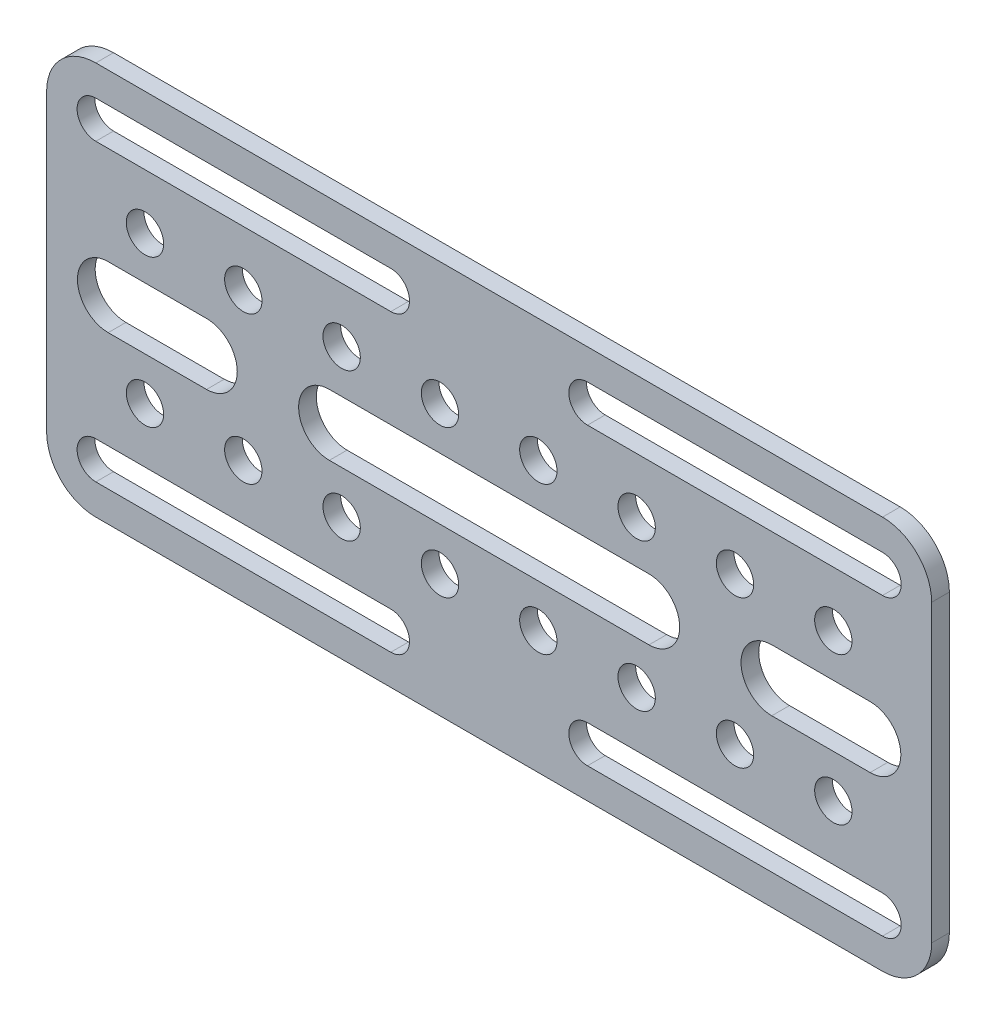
ISO-10303-21;
HEADER;
FILE_DESCRIPTION(('STEP AP214'),'2;1');
FILE_NAME('part.step','',(''),(''),'','','');
FILE_SCHEMA(('AUTOMOTIVE_DESIGN { 1 0 10303 214 1 1 1 1 }'));
ENDSEC;
DATA;
#1=APPLICATION_CONTEXT('core data for automotive mechanical design processes');
#2=APPLICATION_PROTOCOL_DEFINITION('international standard','automotive_design',2000,#1);
#3=PRODUCT_CONTEXT('',#1,'mechanical');
#4=PRODUCT('Part','Part','',(#3));
#5=PRODUCT_RELATED_PRODUCT_CATEGORY('part','',(#4));
#6=PRODUCT_DEFINITION_FORMATION('','',#4);
#7=PRODUCT_DEFINITION_CONTEXT('part definition',#1,'design');
#8=PRODUCT_DEFINITION('design','',#6,#7);
#9=PRODUCT_DEFINITION_SHAPE('','',#8);
#10=(LENGTH_UNIT() NAMED_UNIT(*) SI_UNIT(.MILLI.,.METRE.));
#11=(NAMED_UNIT(*) PLANE_ANGLE_UNIT() SI_UNIT($,.RADIAN.));
#12=(NAMED_UNIT(*) SI_UNIT($,.STERADIAN.) SOLID_ANGLE_UNIT());
#13=UNCERTAINTY_MEASURE_WITH_UNIT(LENGTH_MEASURE(1.E-05),#10,'distance_accuracy_value','');
#14=(GEOMETRIC_REPRESENTATION_CONTEXT(3) GLOBAL_UNCERTAINTY_ASSIGNED_CONTEXT((#13)) GLOBAL_UNIT_ASSIGNED_CONTEXT((#10,
#11,#12)) REPRESENTATION_CONTEXT('',''));
#15=CARTESIAN_POINT('',(0.,0.,0.));
#16=DIRECTION('',(0.,0.,1.));
#17=DIRECTION('',(1.,0.,0.));
#18=AXIS2_PLACEMENT_3D('',#15,#16,#17);
#19=CARTESIAN_POINT('',(-57.15,-25.4,2.286));
#20=DIRECTION('',(1.,0.,0.));
#21=DIRECTION('',(0.,0.,-1.));
#22=AXIS2_PLACEMENT_3D('',#19,#20,#21);
#23=PLANE('',#22);
#24=DIRECTION('',(0.,-1.,0.));
#25=VECTOR('',#24,1.);
#26=CARTESIAN_POINT('',(-57.15,-25.4,0.));
#27=LINE('',#26,#25);
#28=CARTESIAN_POINT('',(-57.15,19.05,0.));
#29=VERTEX_POINT('',#28);
#30=CARTESIAN_POINT('',(-57.15,-19.05,0.));
#31=VERTEX_POINT('',#30);
#32=EDGE_CURVE('E444',#29,#31,#27,.T.);
#33=ORIENTED_EDGE('',*,*,#32,.T.);
#34=DIRECTION('',(0.,0.,-1.));
#35=VECTOR('',#34,1.);
#36=CARTESIAN_POINT('',(-57.15,-19.05,2.286));
#37=LINE('',#36,#35);
#38=CARTESIAN_POINT('',(-57.15,-19.05,2.286));
#39=VERTEX_POINT('',#38);
#40=EDGE_CURVE('E635',#31,#39,#37,.F.);
#41=ORIENTED_EDGE('',*,*,#40,.T.);
#42=DIRECTION('',(0.,-1.,0.));
#43=VECTOR('',#42,1.);
#44=CARTESIAN_POINT('',(-57.15,-25.4,2.286));
#45=LINE('',#44,#43);
#46=CARTESIAN_POINT('',(-57.15,19.05,2.286));
#47=VERTEX_POINT('',#46);
#48=EDGE_CURVE('E461',#47,#39,#45,.T.);
#49=ORIENTED_EDGE('',*,*,#48,.F.);
#50=DIRECTION('',(0.,0.,-1.));
#51=VECTOR('',#50,1.);
#52=CARTESIAN_POINT('',(-57.15,19.05,2.286));
#53=LINE('',#52,#51);
#54=EDGE_CURVE('E632',#47,#29,#53,.T.);
#55=ORIENTED_EDGE('',*,*,#54,.T.);
#56=EDGE_LOOP('',(#33,#41,#49,#55));
#57=FACE_BOUND('',#56,.T.);
#58=ADVANCED_FACE('F33',(#57),#23,.F.);
#59=CARTESIAN_POINT('',(-57.15,-25.4,2.286));
#60=DIRECTION('',(0.,1.,0.));
#61=DIRECTION('',(0.,0.,1.));
#62=AXIS2_PLACEMENT_3D('',#59,#60,#61);
#63=PLANE('',#62);
#64=DIRECTION('',(1.,0.,0.));
#65=VECTOR('',#64,1.);
#66=CARTESIAN_POINT('',(-57.15,-25.4,2.286));
#67=LINE('',#66,#65);
#68=CARTESIAN_POINT('',(-50.8,-25.4,2.286));
#69=VERTEX_POINT('',#68);
#70=CARTESIAN_POINT('',(50.8,-25.4,2.286));
#71=VERTEX_POINT('',#70);
#72=EDGE_CURVE('E464',#69,#71,#67,.T.);
#73=ORIENTED_EDGE('',*,*,#72,.F.);
#74=DIRECTION('',(0.,0.,-1.));
#75=VECTOR('',#74,1.);
#76=CARTESIAN_POINT('',(-50.8,-25.4,2.286));
#77=LINE('',#76,#75);
#78=CARTESIAN_POINT('',(-50.8,-25.4,0.));
#79=VERTEX_POINT('',#78);
#80=EDGE_CURVE('E621',#69,#79,#77,.T.);
#81=ORIENTED_EDGE('',*,*,#80,.T.);
#82=DIRECTION('',(1.,0.,0.));
#83=VECTOR('',#82,1.);
#84=CARTESIAN_POINT('',(-57.15,-25.4,0.));
#85=LINE('',#84,#83);
#86=CARTESIAN_POINT('',(50.8,-25.4,0.));
#87=VERTEX_POINT('',#86);
#88=EDGE_CURVE('E453',#79,#87,#85,.T.);
#89=ORIENTED_EDGE('',*,*,#88,.T.);
#90=DIRECTION('',(0.,0.,-1.));
#91=VECTOR('',#90,1.);
#92=CARTESIAN_POINT('',(50.8,-25.4,2.286));
#93=LINE('',#92,#91);
#94=EDGE_CURVE('E619',#87,#71,#93,.F.);
#95=ORIENTED_EDGE('',*,*,#94,.T.);
#96=EDGE_LOOP('',(#73,#81,#89,#95));
#97=FACE_BOUND('',#96,.T.);
#98=ADVANCED_FACE('F680',(#97),#63,.F.);
#99=CARTESIAN_POINT('',(57.15,-25.4,2.286));
#100=DIRECTION('',(-1.,0.,0.));
#101=DIRECTION('',(0.,0.,1.));
#102=AXIS2_PLACEMENT_3D('',#99,#100,#101);
#103=PLANE('',#102);
#104=DIRECTION('',(0.,1.,0.));
#105=VECTOR('',#104,1.);
#106=CARTESIAN_POINT('',(57.15,-25.4,2.286));
#107=LINE('',#106,#105);
#108=CARTESIAN_POINT('',(57.15,-19.05,2.286));
#109=VERTEX_POINT('',#108);
#110=CARTESIAN_POINT('',(57.15,19.05,2.286));
#111=VERTEX_POINT('',#110);
#112=EDGE_CURVE('E467',#109,#111,#107,.T.);
#113=ORIENTED_EDGE('',*,*,#112,.F.);
#114=DIRECTION('',(0.,0.,-1.));
#115=VECTOR('',#114,1.);
#116=CARTESIAN_POINT('',(57.15,-19.05,2.286));
#117=LINE('',#116,#115);
#118=CARTESIAN_POINT('',(57.15,-19.05,0.));
#119=VERTEX_POINT('',#118);
#120=EDGE_CURVE('E646',#109,#119,#117,.T.);
#121=ORIENTED_EDGE('',*,*,#120,.T.);
#122=DIRECTION('',(0.,1.,0.));
#123=VECTOR('',#122,1.);
#124=CARTESIAN_POINT('',(57.15,-25.4,0.));
#125=LINE('',#124,#123);
#126=CARTESIAN_POINT('',(57.15,19.05,0.));
#127=VERTEX_POINT('',#126);
#128=EDGE_CURVE('E456',#119,#127,#125,.T.);
#129=ORIENTED_EDGE('',*,*,#128,.T.);
#130=DIRECTION('',(0.,0.,-1.));
#131=VECTOR('',#130,1.);
#132=CARTESIAN_POINT('',(57.15,19.05,2.286));
#133=LINE('',#132,#131);
#134=EDGE_CURVE('E644',#127,#111,#133,.F.);
#135=ORIENTED_EDGE('',*,*,#134,.T.);
#136=EDGE_LOOP('',(#113,#121,#129,#135));
#137=FACE_BOUND('',#136,.T.);
#138=ADVANCED_FACE('F652',(#137),#103,.F.);
#139=CARTESIAN_POINT('',(-57.15,25.4,2.286));
#140=DIRECTION('',(0.,-1.,0.));
#141=DIRECTION('',(0.,0.,-1.));
#142=AXIS2_PLACEMENT_3D('',#139,#140,#141);
#143=PLANE('',#142);
#144=DIRECTION('',(-1.,0.,0.));
#145=VECTOR('',#144,1.);
#146=CARTESIAN_POINT('',(-57.15,25.4,2.286));
#147=LINE('',#146,#145);
#148=CARTESIAN_POINT('',(50.8,25.4,2.286));
#149=VERTEX_POINT('',#148);
#150=CARTESIAN_POINT('',(-50.8,25.4,2.286));
#151=VERTEX_POINT('',#150);
#152=EDGE_CURVE('E469',#149,#151,#147,.T.);
#153=ORIENTED_EDGE('',*,*,#152,.F.);
#154=DIRECTION('',(0.,0.,-1.));
#155=VECTOR('',#154,1.);
#156=CARTESIAN_POINT('',(50.8,25.4,2.286));
#157=LINE('',#156,#155);
#158=CARTESIAN_POINT('',(50.8,25.4,0.));
#159=VERTEX_POINT('',#158);
#160=EDGE_CURVE('E11',#149,#159,#157,.T.);
#161=ORIENTED_EDGE('',*,*,#160,.T.);
#162=DIRECTION('',(-1.,0.,0.));
#163=VECTOR('',#162,1.);
#164=CARTESIAN_POINT('',(-57.15,25.4,0.));
#165=LINE('',#164,#163);
#166=CARTESIAN_POINT('',(-50.8,25.4,0.));
#167=VERTEX_POINT('',#166);
#168=EDGE_CURVE('E459',#159,#167,#165,.T.);
#169=ORIENTED_EDGE('',*,*,#168,.T.);
#170=DIRECTION('',(0.,0.,-1.));
#171=VECTOR('',#170,1.);
#172=CARTESIAN_POINT('',(-50.8,25.4,2.286));
#173=LINE('',#172,#171);
#174=EDGE_CURVE('E41',#167,#151,#173,.F.);
#175=ORIENTED_EDGE('',*,*,#174,.T.);
#176=EDGE_LOOP('',(#153,#161,#169,#175));
#177=FACE_BOUND('',#176,.T.);
#178=ADVANCED_FACE('F664',(#177),#143,.F.);
#179=CARTESIAN_POINT('',(-57.15,25.4,2.286));
#180=DIRECTION('',(0.,0.,-1.));
#181=DIRECTION('',(-1.,0.,0.));
#182=AXIS2_PLACEMENT_3D('',#179,#180,#181);
#183=PLANE('',#182);
#184=DIRECTION('',(-1.,0.,0.));
#185=VECTOR('',#184,1.);
#186=CARTESIAN_POINT('',(49.1998,3.96875,2.286));
#187=LINE('',#186,#185);
#188=CARTESIAN_POINT('',(49.1998,3.96875,2.286));
#189=VERTEX_POINT('',#188);
#190=CARTESIAN_POINT('',(36.4998,3.96875,2.286));
#191=VERTEX_POINT('',#190);
#192=EDGE_CURVE('E283',#189,#191,#187,.T.);
#193=ORIENTED_EDGE('',*,*,#192,.F.);
#194=CARTESIAN_POINT('',(49.1998,0.,2.286));
#195=DIRECTION('',(0.,0.,1.));
#196=DIRECTION('',(-1.,0.,0.));
#197=AXIS2_PLACEMENT_3D('',#194,#195,#196);
#198=CIRCLE('',#197,3.96875);
#199=CARTESIAN_POINT('',(49.1998,-3.96875,2.286));
#200=VERTEX_POINT('',#199);
#201=EDGE_CURVE('E287',#200,#189,#198,.T.);
#202=ORIENTED_EDGE('',*,*,#201,.F.);
#203=DIRECTION('',(1.,0.,0.));
#204=VECTOR('',#203,1.);
#205=CARTESIAN_POINT('',(49.1998,-3.96875,2.286));
#206=LINE('',#205,#204);
#207=CARTESIAN_POINT('',(36.4998,-3.96875,2.286));
#208=VERTEX_POINT('',#207);
#209=EDGE_CURVE('E292',#208,#200,#206,.T.);
#210=ORIENTED_EDGE('',*,*,#209,.F.);
#211=CARTESIAN_POINT('',(36.4998,0.,2.286));
#212=DIRECTION('',(0.,0.,1.));
#213=DIRECTION('',(1.,0.,0.));
#214=AXIS2_PLACEMENT_3D('',#211,#212,#213);
#215=CIRCLE('',#214,3.96875);
#216=EDGE_CURVE('E271',#191,#208,#215,.T.);
#217=ORIENTED_EDGE('',*,*,#216,.F.);
#218=EDGE_LOOP('',(#193,#202,#210,#217));
#219=FACE_BOUND('',#218,.T.);
#220=DIRECTION('',(1.,0.,0.));
#221=VECTOR('',#220,1.);
#222=CARTESIAN_POINT('',(-49.1998,-3.96875,2.286));
#223=LINE('',#222,#221);
#224=CARTESIAN_POINT('',(-49.1998,-3.96875,2.286));
#225=VERTEX_POINT('',#224);
#226=CARTESIAN_POINT('',(-36.4998,-3.96875,2.286));
#227=VERTEX_POINT('',#226);
#228=EDGE_CURVE('E312',#225,#227,#223,.T.);
#229=ORIENTED_EDGE('',*,*,#228,.F.);
#230=CARTESIAN_POINT('',(-49.1998,0.,2.286));
#231=DIRECTION('',(0.,0.,1.));
#232=DIRECTION('',(1.,0.,0.));
#233=AXIS2_PLACEMENT_3D('',#230,#231,#232);
#234=CIRCLE('',#233,3.96875);
#235=CARTESIAN_POINT('',(-49.1998,3.96875,2.286));
#236=VERTEX_POINT('',#235);
#237=EDGE_CURVE('E308',#236,#225,#234,.T.);
#238=ORIENTED_EDGE('',*,*,#237,.F.);
#239=DIRECTION('',(-1.,0.,0.));
#240=VECTOR('',#239,1.);
#241=CARTESIAN_POINT('',(-49.1998,3.96875,2.286));
#242=LINE('',#241,#240);
#243=CARTESIAN_POINT('',(-36.4998,3.96875,2.286));
#244=VERTEX_POINT('',#243);
#245=EDGE_CURVE('E318',#244,#236,#242,.T.);
#246=ORIENTED_EDGE('',*,*,#245,.F.);
#247=CARTESIAN_POINT('',(-36.4998,0.,2.286));
#248=DIRECTION('',(0.,0.,1.));
#249=DIRECTION('',(-1.,0.,0.));
#250=AXIS2_PLACEMENT_3D('',#247,#248,#249);
#251=CIRCLE('',#250,3.96875);
#252=EDGE_CURVE('E315',#227,#244,#251,.T.);
#253=ORIENTED_EDGE('',*,*,#252,.F.);
#254=EDGE_LOOP('',(#229,#238,#246,#253));
#255=FACE_BOUND('',#254,.T.);
#256=DIRECTION('',(1.,0.,0.));
#257=VECTOR('',#256,1.);
#258=CARTESIAN_POINT('',(-20.6375,-3.96875,2.286));
#259=LINE('',#258,#257);
#260=CARTESIAN_POINT('',(-20.6375,-3.96875,2.286));
#261=VERTEX_POINT('',#260);
#262=CARTESIAN_POINT('',(20.6375,-3.96875,2.286));
#263=VERTEX_POINT('',#262);
#264=EDGE_CURVE('E344',#261,#263,#259,.T.);
#265=ORIENTED_EDGE('',*,*,#264,.F.);
#266=CARTESIAN_POINT('',(-20.6375,0.,2.286));
#267=DIRECTION('',(0.,0.,1.));
#268=DIRECTION('',(1.,0.,0.));
#269=AXIS2_PLACEMENT_3D('',#266,#267,#268);
#270=CIRCLE('',#269,3.96875);
#271=CARTESIAN_POINT('',(-20.6375,3.96875,2.286));
#272=VERTEX_POINT('',#271);
#273=EDGE_CURVE('E336',#272,#261,#270,.T.);
#274=ORIENTED_EDGE('',*,*,#273,.F.);
#275=DIRECTION('',(-1.,0.,0.));
#276=VECTOR('',#275,1.);
#277=CARTESIAN_POINT('',(-20.6375,3.96875,2.286));
#278=LINE('',#277,#276);
#279=CARTESIAN_POINT('',(20.6375,3.96875,2.286));
#280=VERTEX_POINT('',#279);
#281=EDGE_CURVE('E350',#280,#272,#278,.T.);
#282=ORIENTED_EDGE('',*,*,#281,.F.);
#283=CARTESIAN_POINT('',(20.6375,0.,2.286));
#284=DIRECTION('',(0.,0.,1.));
#285=DIRECTION('',(-1.,0.,0.));
#286=AXIS2_PLACEMENT_3D('',#283,#284,#285);
#287=CIRCLE('',#286,3.96875);
#288=EDGE_CURVE('E347',#263,#280,#287,.T.);
#289=ORIENTED_EDGE('',*,*,#288,.F.);
#290=EDGE_LOOP('',(#265,#274,#282,#289));
#291=FACE_BOUND('',#290,.T.);
#292=CARTESIAN_POINT('',(-31.75,9.525,2.286));
#293=DIRECTION('',(0.,0.,1.));
#294=DIRECTION('',(1.,0.,0.));
#295=AXIS2_PLACEMENT_3D('',#292,#293,#294);
#296=CIRCLE('',#295,2.41299999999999);
#297=CARTESIAN_POINT('',(-29.337,9.525,2.286));
#298=VERTEX_POINT('',#297);
#299=EDGE_CURVE('E377',#298,#298,#296,.T.);
#300=ORIENTED_EDGE('',*,*,#299,.F.);
#301=EDGE_LOOP('',(#300));
#302=FACE_BOUND('',#301,.T.);
#303=CARTESIAN_POINT('',(-44.45,9.525,2.286));
#304=DIRECTION('',(0.,0.,1.));
#305=DIRECTION('',(1.,0.,0.));
#306=AXIS2_PLACEMENT_3D('',#303,#304,#305);
#307=CIRCLE('',#306,2.41299999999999);
#308=CARTESIAN_POINT('',(-42.037,9.525,2.286));
#309=VERTEX_POINT('',#308);
#310=EDGE_CURVE('E380',#309,#309,#307,.T.);
#311=ORIENTED_EDGE('',*,*,#310,.F.);
#312=EDGE_LOOP('',(#311));
#313=FACE_BOUND('',#312,.T.);
#314=DIRECTION('',(1.,0.,0.));
#315=VECTOR('',#314,1.);
#316=CARTESIAN_POINT('',(12.7,16.637,2.286));
#317=LINE('',#316,#315);
#318=CARTESIAN_POINT('',(12.7,16.637,2.286));
#319=VERTEX_POINT('',#318);
#320=CARTESIAN_POINT('',(50.8,16.637,2.286));
#321=VERTEX_POINT('',#320);
#322=EDGE_CURVE('E386',#319,#321,#317,.T.);
#323=ORIENTED_EDGE('',*,*,#322,.F.);
#324=CARTESIAN_POINT('',(12.7,19.05,2.286));
#325=DIRECTION('',(0.,0.,1.));
#326=DIRECTION('',(-1.,0.,0.));
#327=AXIS2_PLACEMENT_3D('',#324,#325,#326);
#328=CIRCLE('',#327,2.413);
#329=CARTESIAN_POINT('',(12.7,21.463,2.286));
#330=VERTEX_POINT('',#329);
#331=EDGE_CURVE('E413',#330,#319,#328,.T.);
#332=ORIENTED_EDGE('',*,*,#331,.F.);
#333=DIRECTION('',(-1.,0.,0.));
#334=VECTOR('',#333,1.);
#335=CARTESIAN_POINT('',(12.7,21.463,2.286));
#336=LINE('',#335,#334);
#337=CARTESIAN_POINT('',(50.8,21.463,2.286));
#338=VERTEX_POINT('',#337);
#339=EDGE_CURVE('E405',#338,#330,#336,.T.);
#340=ORIENTED_EDGE('',*,*,#339,.F.);
#341=CARTESIAN_POINT('',(50.8,19.05,2.286));
#342=DIRECTION('',(0.,0.,1.));
#343=DIRECTION('',(-1.,0.,0.));
#344=AXIS2_PLACEMENT_3D('',#341,#342,#343);
#345=CIRCLE('',#344,2.413);
#346=EDGE_CURVE('E397',#321,#338,#345,.T.);
#347=ORIENTED_EDGE('',*,*,#346,.F.);
#348=EDGE_LOOP('',(#323,#332,#340,#347));
#349=FACE_BOUND('',#348,.T.);
#350=DIRECTION('',(1.,0.,0.));
#351=VECTOR('',#350,1.);
#352=CARTESIAN_POINT('',(-50.8,16.637,2.286));
#353=LINE('',#352,#351);
#354=CARTESIAN_POINT('',(-50.8,16.637,2.286));
#355=VERTEX_POINT('',#354);
#356=CARTESIAN_POINT('',(-12.7,16.637,2.286));
#357=VERTEX_POINT('',#356);
#358=EDGE_CURVE('E420',#355,#357,#353,.T.);
#359=ORIENTED_EDGE('',*,*,#358,.F.);
#360=CARTESIAN_POINT('',(-50.8,19.05,2.286));
#361=DIRECTION('',(0.,0.,1.));
#362=DIRECTION('',(-1.,0.,0.));
#363=AXIS2_PLACEMENT_3D('',#360,#361,#362);
#364=CIRCLE('',#363,2.413);
#365=CARTESIAN_POINT('',(-50.8,21.463,2.286));
#366=VERTEX_POINT('',#365);
#367=EDGE_CURVE('E418',#366,#355,#364,.T.);
#368=ORIENTED_EDGE('',*,*,#367,.F.);
#369=DIRECTION('',(-1.,0.,0.));
#370=VECTOR('',#369,1.);
#371=CARTESIAN_POINT('',(-50.8,21.463,2.286));
#372=LINE('',#371,#370);
#373=CARTESIAN_POINT('',(-12.7,21.463,2.286));
#374=VERTEX_POINT('',#373);
#375=EDGE_CURVE('E426',#374,#366,#372,.T.);
#376=ORIENTED_EDGE('',*,*,#375,.F.);
#377=CARTESIAN_POINT('',(-12.7,19.05,2.286));
#378=DIRECTION('',(0.,0.,1.));
#379=DIRECTION('',(-1.,0.,0.));
#380=AXIS2_PLACEMENT_3D('',#377,#378,#379);
#381=CIRCLE('',#380,2.413);
#382=EDGE_CURVE('E423',#357,#374,#381,.T.);
#383=ORIENTED_EDGE('',*,*,#382,.F.);
#384=EDGE_LOOP('',(#359,#368,#376,#383));
#385=FACE_BOUND('',#384,.T.);
#386=ORIENTED_EDGE('',*,*,#48,.T.);
#387=CARTESIAN_POINT('',(-50.8,-19.05,2.286));
#388=DIRECTION('',(0.,0.,-1.));
#389=DIRECTION('',(-1.,0.,0.));
#390=AXIS2_PLACEMENT_3D('',#387,#388,#389);
#391=CIRCLE('',#390,6.35);
#392=EDGE_CURVE('E642',#39,#69,#391,.F.);
#393=ORIENTED_EDGE('',*,*,#392,.T.);
#394=ORIENTED_EDGE('',*,*,#72,.T.);
#395=CARTESIAN_POINT('',(50.8,-19.05,2.286));
#396=DIRECTION('',(0.,0.,-1.));
#397=DIRECTION('',(-1.,0.,0.));
#398=AXIS2_PLACEMENT_3D('',#395,#396,#397);
#399=CIRCLE('',#398,6.35);
#400=EDGE_CURVE('E640',#71,#109,#399,.F.);
#401=ORIENTED_EDGE('',*,*,#400,.T.);
#402=ORIENTED_EDGE('',*,*,#112,.T.);
#403=CARTESIAN_POINT('',(50.8,19.05,2.286));
#404=DIRECTION('',(0.,0.,-1.));
#405=DIRECTION('',(-1.,0.,0.));
#406=AXIS2_PLACEMENT_3D('',#403,#404,#405);
#407=CIRCLE('',#406,6.35);
#408=EDGE_CURVE('E54',#111,#149,#407,.F.);
#409=ORIENTED_EDGE('',*,*,#408,.T.);
#410=ORIENTED_EDGE('',*,*,#152,.T.);
#411=CARTESIAN_POINT('',(-50.8,19.05,2.286));
#412=DIRECTION('',(0.,0.,-1.));
#413=DIRECTION('',(-1.,0.,0.));
#414=AXIS2_PLACEMENT_3D('',#411,#412,#413);
#415=CIRCLE('',#414,6.35);
#416=EDGE_CURVE('E637',#151,#47,#415,.F.);
#417=ORIENTED_EDGE('',*,*,#416,.T.);
#418=EDGE_LOOP('',(#386,#393,#394,#401,#402,#409,#410,#417));
#419=FACE_BOUND('',#418,.T.);
#420=CARTESIAN_POINT('',(-50.8,-19.05,2.286));
#421=DIRECTION('',(0.,0.,1.));
#422=DIRECTION('',(-1.,0.,0.));
#423=AXIS2_PLACEMENT_3D('',#420,#421,#422);
#424=CIRCLE('',#423,2.413);
#425=CARTESIAN_POINT('',(-50.8,-16.637,2.286));
#426=VERTEX_POINT('',#425);
#427=CARTESIAN_POINT('',(-50.8,-21.463,2.286));
#428=VERTEX_POINT('',#427);
#429=EDGE_CURVE('E471',#426,#428,#424,.T.);
#430=ORIENTED_EDGE('',*,*,#429,.F.);
#431=DIRECTION('',(-1.,0.,0.));
#432=VECTOR('',#431,1.);
#433=CARTESIAN_POINT('',(-50.8,-16.637,2.286));
#434=LINE('',#433,#432);
#435=CARTESIAN_POINT('',(-12.7,-16.637,2.286));
#436=VERTEX_POINT('',#435);
#437=EDGE_CURVE('E473',#436,#426,#434,.T.);
#438=ORIENTED_EDGE('',*,*,#437,.F.);
#439=CARTESIAN_POINT('',(-12.7,-19.05,2.286));
#440=DIRECTION('',(0.,0.,1.));
#441=DIRECTION('',(-1.,0.,0.));
#442=AXIS2_PLACEMENT_3D('',#439,#440,#441);
#443=CIRCLE('',#442,2.413);
#444=CARTESIAN_POINT('',(-12.7,-21.463,2.286));
#445=VERTEX_POINT('',#444);
#446=EDGE_CURVE('E476',#445,#436,#443,.T.);
#447=ORIENTED_EDGE('',*,*,#446,.F.);
#448=DIRECTION('',(1.,0.,0.));
#449=VECTOR('',#448,1.);
#450=CARTESIAN_POINT('',(-50.8,-21.463,2.286));
#451=LINE('',#450,#449);
#452=EDGE_CURVE('E479',#428,#445,#451,.T.);
#453=ORIENTED_EDGE('',*,*,#452,.F.);
#454=EDGE_LOOP('',(#430,#438,#447,#453));
#455=FACE_BOUND('',#454,.T.);
#456=CARTESIAN_POINT('',(12.7,-19.05,2.286));
#457=DIRECTION('',(0.,0.,1.));
#458=DIRECTION('',(-1.,0.,0.));
#459=AXIS2_PLACEMENT_3D('',#456,#457,#458);
#460=CIRCLE('',#459,2.413);
#461=CARTESIAN_POINT('',(12.7,-16.637,2.286));
#462=VERTEX_POINT('',#461);
#463=CARTESIAN_POINT('',(12.7,-21.463,2.286));
#464=VERTEX_POINT('',#463);
#465=EDGE_CURVE('E503',#462,#464,#460,.T.);
#466=ORIENTED_EDGE('',*,*,#465,.F.);
#467=DIRECTION('',(-1.,0.,0.));
#468=VECTOR('',#467,1.);
#469=CARTESIAN_POINT('',(12.7,-16.637,2.286));
#470=LINE('',#469,#468);
#471=CARTESIAN_POINT('',(50.8,-16.637,2.286));
#472=VERTEX_POINT('',#471);
#473=EDGE_CURVE('E505',#472,#462,#470,.T.);
#474=ORIENTED_EDGE('',*,*,#473,.F.);
#475=CARTESIAN_POINT('',(50.8,-19.05,2.286));
#476=DIRECTION('',(0.,0.,1.));
#477=DIRECTION('',(-1.,0.,0.));
#478=AXIS2_PLACEMENT_3D('',#475,#476,#477);
#479=CIRCLE('',#478,2.413);
#480=CARTESIAN_POINT('',(50.8,-21.463,2.286));
#481=VERTEX_POINT('',#480);
#482=EDGE_CURVE('E508',#481,#472,#479,.T.);
#483=ORIENTED_EDGE('',*,*,#482,.F.);
#484=DIRECTION('',(1.,0.,0.));
#485=VECTOR('',#484,1.);
#486=CARTESIAN_POINT('',(12.7,-21.463,2.286));
#487=LINE('',#486,#485);
#488=EDGE_CURVE('E511',#464,#481,#487,.T.);
#489=ORIENTED_EDGE('',*,*,#488,.F.);
#490=EDGE_LOOP('',(#466,#474,#483,#489));
#491=FACE_BOUND('',#490,.T.);
#492=CARTESIAN_POINT('',(-19.0500000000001,9.525,2.286));
#493=DIRECTION('',(0.,0.,1.));
#494=DIRECTION('',(1.,0.,0.));
#495=AXIS2_PLACEMENT_3D('',#492,#493,#494);
#496=CIRCLE('',#495,2.41299999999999);
#497=CARTESIAN_POINT('',(-16.6370000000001,9.525,2.286));
#498=VERTEX_POINT('',#497);
#499=EDGE_CURVE('E538',#498,#498,#496,.T.);
#500=ORIENTED_EDGE('',*,*,#499,.F.);
#501=EDGE_LOOP('',(#500));
#502=FACE_BOUND('',#501,.T.);
#503=CARTESIAN_POINT('',(-6.35000000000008,9.525,2.286));
#504=DIRECTION('',(0.,0.,1.));
#505=DIRECTION('',(1.,0.,0.));
#506=AXIS2_PLACEMENT_3D('',#503,#504,#505);
#507=CIRCLE('',#506,2.41299999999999);
#508=CARTESIAN_POINT('',(-3.93700000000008,9.525,2.286));
#509=VERTEX_POINT('',#508);
#510=EDGE_CURVE('E544',#509,#509,#507,.T.);
#511=ORIENTED_EDGE('',*,*,#510,.F.);
#512=EDGE_LOOP('',(#511));
#513=FACE_BOUND('',#512,.T.);
#514=CARTESIAN_POINT('',(6.3499999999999,9.525,2.286));
#515=DIRECTION('',(0.,0.,1.));
#516=DIRECTION('',(1.,0.,0.));
#517=AXIS2_PLACEMENT_3D('',#514,#515,#516);
#518=CIRCLE('',#517,2.41299999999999);
#519=CARTESIAN_POINT('',(8.76299999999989,9.525,2.286));
#520=VERTEX_POINT('',#519);
#521=EDGE_CURVE('E550',#520,#520,#518,.T.);
#522=ORIENTED_EDGE('',*,*,#521,.F.);
#523=EDGE_LOOP('',(#522));
#524=FACE_BOUND('',#523,.T.);
#525=CARTESIAN_POINT('',(19.0499999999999,9.525,2.286));
#526=DIRECTION('',(0.,0.,1.));
#527=DIRECTION('',(1.,0.,0.));
#528=AXIS2_PLACEMENT_3D('',#525,#526,#527);
#529=CIRCLE('',#528,2.41299999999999);
#530=CARTESIAN_POINT('',(21.4629999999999,9.525,2.286));
#531=VERTEX_POINT('',#530);
#532=EDGE_CURVE('E556',#531,#531,#529,.T.);
#533=ORIENTED_EDGE('',*,*,#532,.F.);
#534=EDGE_LOOP('',(#533));
#535=FACE_BOUND('',#534,.T.);
#536=CARTESIAN_POINT('',(31.7499999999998,9.525,2.286));
#537=DIRECTION('',(0.,0.,1.));
#538=DIRECTION('',(1.,0.,0.));
#539=AXIS2_PLACEMENT_3D('',#536,#537,#538);
#540=CIRCLE('',#539,2.41299999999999);
#541=CARTESIAN_POINT('',(34.1629999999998,9.525,2.286));
#542=VERTEX_POINT('',#541);
#543=EDGE_CURVE('E562',#542,#542,#540,.T.);
#544=ORIENTED_EDGE('',*,*,#543,.F.);
#545=EDGE_LOOP('',(#544));
#546=FACE_BOUND('',#545,.T.);
#547=CARTESIAN_POINT('',(44.4499999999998,9.525,2.286));
#548=DIRECTION('',(0.,0.,1.));
#549=DIRECTION('',(1.,0.,0.));
#550=AXIS2_PLACEMENT_3D('',#547,#548,#549);
#551=CIRCLE('',#550,2.41299999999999);
#552=CARTESIAN_POINT('',(46.8629999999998,9.525,2.286));
#553=VERTEX_POINT('',#552);
#554=EDGE_CURVE('E568',#553,#553,#551,.T.);
#555=ORIENTED_EDGE('',*,*,#554,.F.);
#556=EDGE_LOOP('',(#555));
#557=FACE_BOUND('',#556,.T.);
#558=CARTESIAN_POINT('',(-44.45,-9.525,2.286));
#559=DIRECTION('',(0.,0.,1.));
#560=DIRECTION('',(1.,0.,0.));
#561=AXIS2_PLACEMENT_3D('',#558,#559,#560);
#562=CIRCLE('',#561,2.41299999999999);
#563=CARTESIAN_POINT('',(-42.037,-9.525,2.286));
#564=VERTEX_POINT('',#563);
#565=EDGE_CURVE('E574',#564,#564,#562,.T.);
#566=ORIENTED_EDGE('',*,*,#565,.F.);
#567=EDGE_LOOP('',(#566));
#568=FACE_BOUND('',#567,.T.);
#569=CARTESIAN_POINT('',(-31.75,-9.525,2.286));
#570=DIRECTION('',(0.,0.,1.));
#571=DIRECTION('',(1.,0.,0.));
#572=AXIS2_PLACEMENT_3D('',#569,#570,#571);
#573=CIRCLE('',#572,2.41299999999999);
#574=CARTESIAN_POINT('',(-29.337,-9.525,2.286));
#575=VERTEX_POINT('',#574);
#576=EDGE_CURVE('E580',#575,#575,#573,.T.);
#577=ORIENTED_EDGE('',*,*,#576,.F.);
#578=EDGE_LOOP('',(#577));
#579=FACE_BOUND('',#578,.T.);
#580=CARTESIAN_POINT('',(-19.0500000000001,-9.525,2.286));
#581=DIRECTION('',(0.,0.,1.));
#582=DIRECTION('',(1.,0.,0.));
#583=AXIS2_PLACEMENT_3D('',#580,#581,#582);
#584=CIRCLE('',#583,2.41299999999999);
#585=CARTESIAN_POINT('',(-16.6370000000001,-9.525,2.286));
#586=VERTEX_POINT('',#585);
#587=EDGE_CURVE('E586',#586,#586,#584,.T.);
#588=ORIENTED_EDGE('',*,*,#587,.F.);
#589=EDGE_LOOP('',(#588));
#590=FACE_BOUND('',#589,.T.);
#591=CARTESIAN_POINT('',(-6.35000000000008,-9.525,2.286));
#592=DIRECTION('',(0.,0.,1.));
#593=DIRECTION('',(1.,0.,0.));
#594=AXIS2_PLACEMENT_3D('',#591,#592,#593);
#595=CIRCLE('',#594,2.41299999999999);
#596=CARTESIAN_POINT('',(-3.93700000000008,-9.525,2.286));
#597=VERTEX_POINT('',#596);
#598=EDGE_CURVE('E592',#597,#597,#595,.T.);
#599=ORIENTED_EDGE('',*,*,#598,.F.);
#600=EDGE_LOOP('',(#599));
#601=FACE_BOUND('',#600,.T.);
#602=CARTESIAN_POINT('',(6.3499999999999,-9.525,2.286));
#603=DIRECTION('',(0.,0.,1.));
#604=DIRECTION('',(1.,0.,0.));
#605=AXIS2_PLACEMENT_3D('',#602,#603,#604);
#606=CIRCLE('',#605,2.41299999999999);
#607=CARTESIAN_POINT('',(8.76299999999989,-9.525,2.286));
#608=VERTEX_POINT('',#607);
#609=EDGE_CURVE('E598',#608,#608,#606,.T.);
#610=ORIENTED_EDGE('',*,*,#609,.F.);
#611=EDGE_LOOP('',(#610));
#612=FACE_BOUND('',#611,.T.);
#613=CARTESIAN_POINT('',(19.0499999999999,-9.525,2.286));
#614=DIRECTION('',(0.,0.,1.));
#615=DIRECTION('',(1.,0.,0.));
#616=AXIS2_PLACEMENT_3D('',#613,#614,#615);
#617=CIRCLE('',#616,2.41299999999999);
#618=CARTESIAN_POINT('',(21.4629999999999,-9.525,2.286));
#619=VERTEX_POINT('',#618);
#620=EDGE_CURVE('E604',#619,#619,#617,.T.);
#621=ORIENTED_EDGE('',*,*,#620,.F.);
#622=EDGE_LOOP('',(#621));
#623=FACE_BOUND('',#622,.T.);
#624=CARTESIAN_POINT('',(31.7499999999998,-9.525,2.286));
#625=DIRECTION('',(0.,0.,1.));
#626=DIRECTION('',(1.,0.,0.));
#627=AXIS2_PLACEMENT_3D('',#624,#625,#626);
#628=CIRCLE('',#627,2.41299999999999);
#629=CARTESIAN_POINT('',(34.1629999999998,-9.525,2.286));
#630=VERTEX_POINT('',#629);
#631=EDGE_CURVE('E610',#630,#630,#628,.T.);
#632=ORIENTED_EDGE('',*,*,#631,.F.);
#633=EDGE_LOOP('',(#632));
#634=FACE_BOUND('',#633,.T.);
#635=CARTESIAN_POINT('',(44.4499999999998,-9.525,2.286));
#636=DIRECTION('',(0.,0.,1.));
#637=DIRECTION('',(1.,0.,0.));
#638=AXIS2_PLACEMENT_3D('',#635,#636,#637);
#639=CIRCLE('',#638,2.41299999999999);
#640=CARTESIAN_POINT('',(46.8629999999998,-9.525,2.286));
#641=VERTEX_POINT('',#640);
#642=EDGE_CURVE('E616',#641,#641,#639,.T.);
#643=ORIENTED_EDGE('',*,*,#642,.F.);
#644=EDGE_LOOP('',(#643));
#645=FACE_BOUND('',#644,.T.);
#646=ADVANCED_FACE('F289',(#219,#255,#291,#302,#313,#349,#385,#419,#455,#491,#502,#513,#524,
#535,#546,#557,#568,#579,#590,#601,#612,#623,#634,#645),#183,.F.);
#647=CARTESIAN_POINT('',(-57.15,25.4,0.));
#648=DIRECTION('',(0.,0.,-1.));
#649=DIRECTION('',(-1.,0.,0.));
#650=AXIS2_PLACEMENT_3D('',#647,#648,#649);
#651=PLANE('',#650);
#652=CARTESIAN_POINT('',(49.1998,0.,0.));
#653=DIRECTION('',(0.,0.,1.));
#654=DIRECTION('',(-1.,0.,0.));
#655=AXIS2_PLACEMENT_3D('',#652,#653,#654);
#656=CIRCLE('',#655,3.96875);
#657=CARTESIAN_POINT('',(49.1998,-3.96875,0.));
#658=VERTEX_POINT('',#657);
#659=CARTESIAN_POINT('',(49.1998,3.96875,0.));
#660=VERTEX_POINT('',#659);
#661=EDGE_CURVE('E294',#658,#660,#656,.T.);
#662=ORIENTED_EDGE('',*,*,#661,.T.);
#663=DIRECTION('',(-1.,0.,0.));
#664=VECTOR('',#663,1.);
#665=CARTESIAN_POINT('',(49.1998,3.96875,0.));
#666=LINE('',#665,#664);
#667=CARTESIAN_POINT('',(36.4998,3.96875,0.));
#668=VERTEX_POINT('',#667);
#669=EDGE_CURVE('E300',#660,#668,#666,.T.);
#670=ORIENTED_EDGE('',*,*,#669,.T.);
#671=CARTESIAN_POINT('',(36.4998,0.,0.));
#672=DIRECTION('',(0.,0.,1.));
#673=DIRECTION('',(1.,0.,0.));
#674=AXIS2_PLACEMENT_3D('',#671,#672,#673);
#675=CIRCLE('',#674,3.96875);
#676=CARTESIAN_POINT('',(36.4998,-3.96875,0.));
#677=VERTEX_POINT('',#676);
#678=EDGE_CURVE('E274',#668,#677,#675,.T.);
#679=ORIENTED_EDGE('',*,*,#678,.T.);
#680=DIRECTION('',(1.,0.,0.));
#681=VECTOR('',#680,1.);
#682=CARTESIAN_POINT('',(49.1998,-3.96875,0.));
#683=LINE('',#682,#681);
#684=EDGE_CURVE('E303',#677,#658,#683,.T.);
#685=ORIENTED_EDGE('',*,*,#684,.T.);
#686=EDGE_LOOP('',(#662,#670,#679,#685));
#687=FACE_BOUND('',#686,.T.);
#688=CARTESIAN_POINT('',(-49.1998,0.,0.));
#689=DIRECTION('',(0.,0.,1.));
#690=DIRECTION('',(1.,0.,0.));
#691=AXIS2_PLACEMENT_3D('',#688,#689,#690);
#692=CIRCLE('',#691,3.96875);
#693=CARTESIAN_POINT('',(-49.1998,3.96875,0.));
#694=VERTEX_POINT('',#693);
#695=CARTESIAN_POINT('',(-49.1998,-3.96875,0.));
#696=VERTEX_POINT('',#695);
#697=EDGE_CURVE('E321',#694,#696,#692,.T.);
#698=ORIENTED_EDGE('',*,*,#697,.T.);
#699=DIRECTION('',(1.,0.,0.));
#700=VECTOR('',#699,1.);
#701=CARTESIAN_POINT('',(-49.1998,-3.96875,0.));
#702=LINE('',#701,#700);
#703=CARTESIAN_POINT('',(-36.4998,-3.96875,0.));
#704=VERTEX_POINT('',#703);
#705=EDGE_CURVE('E324',#696,#704,#702,.T.);
#706=ORIENTED_EDGE('',*,*,#705,.T.);
#707=CARTESIAN_POINT('',(-36.4998,0.,0.));
#708=DIRECTION('',(0.,0.,1.));
#709=DIRECTION('',(-1.,0.,0.));
#710=AXIS2_PLACEMENT_3D('',#707,#708,#709);
#711=CIRCLE('',#710,3.96875);
#712=CARTESIAN_POINT('',(-36.4998,3.96875,0.));
#713=VERTEX_POINT('',#712);
#714=EDGE_CURVE('E327',#704,#713,#711,.T.);
#715=ORIENTED_EDGE('',*,*,#714,.T.);
#716=DIRECTION('',(-1.,0.,0.));
#717=VECTOR('',#716,1.);
#718=CARTESIAN_POINT('',(-49.1998,3.96875,0.));
#719=LINE('',#718,#717);
#720=EDGE_CURVE('E330',#713,#694,#719,.T.);
#721=ORIENTED_EDGE('',*,*,#720,.T.);
#722=EDGE_LOOP('',(#698,#706,#715,#721));
#723=FACE_BOUND('',#722,.T.);
#724=CARTESIAN_POINT('',(-20.6375,0.,0.));
#725=DIRECTION('',(0.,0.,1.));
#726=DIRECTION('',(1.,0.,0.));
#727=AXIS2_PLACEMENT_3D('',#724,#725,#726);
#728=CIRCLE('',#727,3.96875);
#729=CARTESIAN_POINT('',(-20.6375,3.96875,0.));
#730=VERTEX_POINT('',#729);
#731=CARTESIAN_POINT('',(-20.6375,-3.96875,0.));
#732=VERTEX_POINT('',#731);
#733=EDGE_CURVE('E353',#730,#732,#728,.T.);
#734=ORIENTED_EDGE('',*,*,#733,.T.);
#735=DIRECTION('',(1.,0.,0.));
#736=VECTOR('',#735,1.);
#737=CARTESIAN_POINT('',(-20.6375,-3.96875,0.));
#738=LINE('',#737,#736);
#739=CARTESIAN_POINT('',(20.6375,-3.96875,0.));
#740=VERTEX_POINT('',#739);
#741=EDGE_CURVE('E356',#732,#740,#738,.T.);
#742=ORIENTED_EDGE('',*,*,#741,.T.);
#743=CARTESIAN_POINT('',(20.6375,0.,0.));
#744=DIRECTION('',(0.,0.,1.));
#745=DIRECTION('',(-1.,0.,0.));
#746=AXIS2_PLACEMENT_3D('',#743,#744,#745);
#747=CIRCLE('',#746,3.96875);
#748=CARTESIAN_POINT('',(20.6375,3.96875,0.));
#749=VERTEX_POINT('',#748);
#750=EDGE_CURVE('E359',#740,#749,#747,.T.);
#751=ORIENTED_EDGE('',*,*,#750,.T.);
#752=DIRECTION('',(-1.,0.,0.));
#753=VECTOR('',#752,1.);
#754=CARTESIAN_POINT('',(-20.6375,3.96875,0.));
#755=LINE('',#754,#753);
#756=EDGE_CURVE('E362',#749,#730,#755,.T.);
#757=ORIENTED_EDGE('',*,*,#756,.T.);
#758=EDGE_LOOP('',(#734,#742,#751,#757));
#759=FACE_BOUND('',#758,.T.);
#760=CARTESIAN_POINT('',(-31.75,9.525,0.));
#761=DIRECTION('',(0.,0.,1.));
#762=DIRECTION('',(1.,0.,0.));
#763=AXIS2_PLACEMENT_3D('',#760,#761,#762);
#764=CIRCLE('',#763,2.41299999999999);
#765=CARTESIAN_POINT('',(-29.337,9.525,0.));
#766=VERTEX_POINT('',#765);
#767=EDGE_CURVE('E368',#766,#766,#764,.T.);
#768=ORIENTED_EDGE('',*,*,#767,.T.);
#769=EDGE_LOOP('',(#768));
#770=FACE_BOUND('',#769,.T.);
#771=CARTESIAN_POINT('',(-44.45,9.525,0.));
#772=DIRECTION('',(0.,0.,1.));
#773=DIRECTION('',(1.,0.,0.));
#774=AXIS2_PLACEMENT_3D('',#771,#772,#773);
#775=CIRCLE('',#774,2.41299999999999);
#776=CARTESIAN_POINT('',(-42.037,9.525,0.));
#777=VERTEX_POINT('',#776);
#778=EDGE_CURVE('E383',#777,#777,#775,.T.);
#779=ORIENTED_EDGE('',*,*,#778,.T.);
#780=EDGE_LOOP('',(#779));
#781=FACE_BOUND('',#780,.T.);
#782=CARTESIAN_POINT('',(12.7,19.05,0.));
#783=DIRECTION('',(0.,0.,1.));
#784=DIRECTION('',(-1.,0.,0.));
#785=AXIS2_PLACEMENT_3D('',#782,#783,#784);
#786=CIRCLE('',#785,2.413);
#787=CARTESIAN_POINT('',(12.7,21.463,0.));
#788=VERTEX_POINT('',#787);
#789=CARTESIAN_POINT('',(12.7,16.637,0.));
#790=VERTEX_POINT('',#789);
#791=EDGE_CURVE('E415',#788,#790,#786,.T.);
#792=ORIENTED_EDGE('',*,*,#791,.T.);
#793=DIRECTION('',(1.,0.,0.));
#794=VECTOR('',#793,1.);
#795=CARTESIAN_POINT('',(12.7,16.637,0.));
#796=LINE('',#795,#794);
#797=CARTESIAN_POINT('',(50.8,16.637,0.));
#798=VERTEX_POINT('',#797);
#799=EDGE_CURVE('E388',#790,#798,#796,.T.);
#800=ORIENTED_EDGE('',*,*,#799,.T.);
#801=CARTESIAN_POINT('',(50.8,19.05,0.));
#802=DIRECTION('',(0.,0.,1.));
#803=DIRECTION('',(-1.,0.,0.));
#804=AXIS2_PLACEMENT_3D('',#801,#802,#803);
#805=CIRCLE('',#804,2.413);
#806=CARTESIAN_POINT('',(50.8,21.463,0.));
#807=VERTEX_POINT('',#806);
#808=EDGE_CURVE('E402',#798,#807,#805,.T.);
#809=ORIENTED_EDGE('',*,*,#808,.T.);
#810=DIRECTION('',(-1.,0.,0.));
#811=VECTOR('',#810,1.);
#812=CARTESIAN_POINT('',(12.7,21.463,0.));
#813=LINE('',#812,#811);
#814=EDGE_CURVE('E410',#807,#788,#813,.T.);
#815=ORIENTED_EDGE('',*,*,#814,.T.);
#816=EDGE_LOOP('',(#792,#800,#809,#815));
#817=FACE_BOUND('',#816,.T.);
#818=CARTESIAN_POINT('',(-50.8,19.05,0.));
#819=DIRECTION('',(0.,0.,1.));
#820=DIRECTION('',(-1.,0.,0.));
#821=AXIS2_PLACEMENT_3D('',#818,#819,#820);
#822=CIRCLE('',#821,2.413);
#823=CARTESIAN_POINT('',(-50.8,21.463,0.));
#824=VERTEX_POINT('',#823);
#825=CARTESIAN_POINT('',(-50.8,16.637,0.));
#826=VERTEX_POINT('',#825);
#827=EDGE_CURVE('E429',#824,#826,#822,.T.);
#828=ORIENTED_EDGE('',*,*,#827,.T.);
#829=DIRECTION('',(1.,0.,0.));
#830=VECTOR('',#829,1.);
#831=CARTESIAN_POINT('',(-50.8,16.637,0.));
#832=LINE('',#831,#830);
#833=CARTESIAN_POINT('',(-12.7,16.637,0.));
#834=VERTEX_POINT('',#833);
#835=EDGE_CURVE('E432',#826,#834,#832,.T.);
#836=ORIENTED_EDGE('',*,*,#835,.T.);
#837=CARTESIAN_POINT('',(-12.7,19.05,0.));
#838=DIRECTION('',(0.,0.,1.));
#839=DIRECTION('',(-1.,0.,0.));
#840=AXIS2_PLACEMENT_3D('',#837,#838,#839);
#841=CIRCLE('',#840,2.413);
#842=CARTESIAN_POINT('',(-12.7,21.463,0.));
#843=VERTEX_POINT('',#842);
#844=EDGE_CURVE('E435',#834,#843,#841,.T.);
#845=ORIENTED_EDGE('',*,*,#844,.T.);
#846=DIRECTION('',(-1.,0.,0.));
#847=VECTOR('',#846,1.);
#848=CARTESIAN_POINT('',(-50.8,21.463,0.));
#849=LINE('',#848,#847);
#850=EDGE_CURVE('E438',#843,#824,#849,.T.);
#851=ORIENTED_EDGE('',*,*,#850,.T.);
#852=EDGE_LOOP('',(#828,#836,#845,#851));
#853=FACE_BOUND('',#852,.T.);
#854=ORIENTED_EDGE('',*,*,#88,.F.);
#855=CARTESIAN_POINT('',(-50.8,-19.05,0.));
#856=DIRECTION('',(0.,0.,-1.));
#857=DIRECTION('',(-1.,0.,0.));
#858=AXIS2_PLACEMENT_3D('',#855,#856,#857);
#859=CIRCLE('',#858,6.35);
#860=EDGE_CURVE('E630',#79,#31,#859,.T.);
#861=ORIENTED_EDGE('',*,*,#860,.T.);
#862=ORIENTED_EDGE('',*,*,#32,.F.);
#863=CARTESIAN_POINT('',(-50.8,19.05,0.));
#864=DIRECTION('',(0.,0.,-1.));
#865=DIRECTION('',(-1.,0.,0.));
#866=AXIS2_PLACEMENT_3D('',#863,#864,#865);
#867=CIRCLE('',#866,6.35);
#868=EDGE_CURVE('E624',#29,#167,#867,.T.);
#869=ORIENTED_EDGE('',*,*,#868,.T.);
#870=ORIENTED_EDGE('',*,*,#168,.F.);
#871=CARTESIAN_POINT('',(50.8,19.05,0.));
#872=DIRECTION('',(0.,0.,-1.));
#873=DIRECTION('',(-1.,0.,0.));
#874=AXIS2_PLACEMENT_3D('',#871,#872,#873);
#875=CIRCLE('',#874,6.35);
#876=EDGE_CURVE('E626',#159,#127,#875,.T.);
#877=ORIENTED_EDGE('',*,*,#876,.T.);
#878=ORIENTED_EDGE('',*,*,#128,.F.);
#879=CARTESIAN_POINT('',(50.8,-19.05,0.));
#880=DIRECTION('',(0.,0.,-1.));
#881=DIRECTION('',(-1.,0.,0.));
#882=AXIS2_PLACEMENT_3D('',#879,#880,#881);
#883=CIRCLE('',#882,6.35);
#884=EDGE_CURVE('E628',#119,#87,#883,.T.);
#885=ORIENTED_EDGE('',*,*,#884,.T.);
#886=EDGE_LOOP('',(#854,#861,#862,#869,#870,#877,#878,#885));
#887=FACE_BOUND('',#886,.T.);
#888=CARTESIAN_POINT('',(-50.8,-19.05,0.));
#889=DIRECTION('',(0.,0.,1.));
#890=DIRECTION('',(-1.,0.,0.));
#891=AXIS2_PLACEMENT_3D('',#888,#889,#890);
#892=CIRCLE('',#891,2.413);
#893=CARTESIAN_POINT('',(-50.8,-16.637,0.));
#894=VERTEX_POINT('',#893);
#895=CARTESIAN_POINT('',(-50.8,-21.463,0.));
#896=VERTEX_POINT('',#895);
#897=EDGE_CURVE('E482',#894,#896,#892,.T.);
#898=ORIENTED_EDGE('',*,*,#897,.T.);
#899=DIRECTION('',(1.,0.,0.));
#900=VECTOR('',#899,1.);
#901=CARTESIAN_POINT('',(-50.8,-21.463,0.));
#902=LINE('',#901,#900);
#903=CARTESIAN_POINT('',(-12.7,-21.463,0.));
#904=VERTEX_POINT('',#903);
#905=EDGE_CURVE('E484',#896,#904,#902,.T.);
#906=ORIENTED_EDGE('',*,*,#905,.T.);
#907=CARTESIAN_POINT('',(-12.7,-19.05,0.));
#908=DIRECTION('',(0.,0.,1.));
#909=DIRECTION('',(-1.,0.,0.));
#910=AXIS2_PLACEMENT_3D('',#907,#908,#909);
#911=CIRCLE('',#910,2.413);
#912=CARTESIAN_POINT('',(-12.7,-16.637,0.));
#913=VERTEX_POINT('',#912);
#914=EDGE_CURVE('E486',#904,#913,#911,.T.);
#915=ORIENTED_EDGE('',*,*,#914,.T.);
#916=DIRECTION('',(-1.,0.,0.));
#917=VECTOR('',#916,1.);
#918=CARTESIAN_POINT('',(-50.8,-16.637,0.));
#919=LINE('',#918,#917);
#920=EDGE_CURVE('E488',#913,#894,#919,.T.);
#921=ORIENTED_EDGE('',*,*,#920,.T.);
#922=EDGE_LOOP('',(#898,#906,#915,#921));
#923=FACE_BOUND('',#922,.T.);
#924=CARTESIAN_POINT('',(12.7,-19.05,0.));
#925=DIRECTION('',(0.,0.,1.));
#926=DIRECTION('',(-1.,0.,0.));
#927=AXIS2_PLACEMENT_3D('',#924,#925,#926);
#928=CIRCLE('',#927,2.413);
#929=CARTESIAN_POINT('',(12.7,-16.637,0.));
#930=VERTEX_POINT('',#929);
#931=CARTESIAN_POINT('',(12.7,-21.463,0.));
#932=VERTEX_POINT('',#931);
#933=EDGE_CURVE('E514',#930,#932,#928,.T.);
#934=ORIENTED_EDGE('',*,*,#933,.T.);
#935=DIRECTION('',(1.,0.,0.));
#936=VECTOR('',#935,1.);
#937=CARTESIAN_POINT('',(12.7,-21.463,0.));
#938=LINE('',#937,#936);
#939=CARTESIAN_POINT('',(50.8,-21.463,0.));
#940=VERTEX_POINT('',#939);
#941=EDGE_CURVE('E516',#932,#940,#938,.T.);
#942=ORIENTED_EDGE('',*,*,#941,.T.);
#943=CARTESIAN_POINT('',(50.8,-19.05,0.));
#944=DIRECTION('',(0.,0.,1.));
#945=DIRECTION('',(-1.,0.,0.));
#946=AXIS2_PLACEMENT_3D('',#943,#944,#945);
#947=CIRCLE('',#946,2.413);
#948=CARTESIAN_POINT('',(50.8,-16.637,0.));
#949=VERTEX_POINT('',#948);
#950=EDGE_CURVE('E518',#940,#949,#947,.T.);
#951=ORIENTED_EDGE('',*,*,#950,.T.);
#952=DIRECTION('',(-1.,0.,0.));
#953=VECTOR('',#952,1.);
#954=CARTESIAN_POINT('',(12.7,-16.637,0.));
#955=LINE('',#954,#953);
#956=EDGE_CURVE('E520',#949,#930,#955,.T.);
#957=ORIENTED_EDGE('',*,*,#956,.T.);
#958=EDGE_LOOP('',(#934,#942,#951,#957));
#959=FACE_BOUND('',#958,.T.);
#960=CARTESIAN_POINT('',(-19.0500000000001,9.525,0.));
#961=DIRECTION('',(0.,0.,1.));
#962=DIRECTION('',(1.,0.,0.));
#963=AXIS2_PLACEMENT_3D('',#960,#961,#962);
#964=CIRCLE('',#963,2.41299999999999);
#965=CARTESIAN_POINT('',(-16.6370000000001,9.525,0.));
#966=VERTEX_POINT('',#965);
#967=EDGE_CURVE('E535',#966,#966,#964,.T.);
#968=ORIENTED_EDGE('',*,*,#967,.T.);
#969=EDGE_LOOP('',(#968));
#970=FACE_BOUND('',#969,.T.);
#971=CARTESIAN_POINT('',(-6.35000000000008,9.525,0.));
#972=DIRECTION('',(0.,0.,1.));
#973=DIRECTION('',(1.,0.,0.));
#974=AXIS2_PLACEMENT_3D('',#971,#972,#973);
#975=CIRCLE('',#974,2.41299999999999);
#976=CARTESIAN_POINT('',(-3.93700000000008,9.525,0.));
#977=VERTEX_POINT('',#976);
#978=EDGE_CURVE('E541',#977,#977,#975,.T.);
#979=ORIENTED_EDGE('',*,*,#978,.T.);
#980=EDGE_LOOP('',(#979));
#981=FACE_BOUND('',#980,.T.);
#982=CARTESIAN_POINT('',(6.3499999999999,9.525,0.));
#983=DIRECTION('',(0.,0.,1.));
#984=DIRECTION('',(1.,0.,0.));
#985=AXIS2_PLACEMENT_3D('',#982,#983,#984);
#986=CIRCLE('',#985,2.41299999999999);
#987=CARTESIAN_POINT('',(8.76299999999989,9.525,0.));
#988=VERTEX_POINT('',#987);
#989=EDGE_CURVE('E547',#988,#988,#986,.T.);
#990=ORIENTED_EDGE('',*,*,#989,.T.);
#991=EDGE_LOOP('',(#990));
#992=FACE_BOUND('',#991,.T.);
#993=CARTESIAN_POINT('',(19.0499999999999,9.525,0.));
#994=DIRECTION('',(0.,0.,1.));
#995=DIRECTION('',(1.,0.,0.));
#996=AXIS2_PLACEMENT_3D('',#993,#994,#995);
#997=CIRCLE('',#996,2.41299999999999);
#998=CARTESIAN_POINT('',(21.4629999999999,9.525,0.));
#999=VERTEX_POINT('',#998);
#1000=EDGE_CURVE('E553',#999,#999,#997,.T.);
#1001=ORIENTED_EDGE('',*,*,#1000,.T.);
#1002=EDGE_LOOP('',(#1001));
#1003=FACE_BOUND('',#1002,.T.);
#1004=CARTESIAN_POINT('',(31.7499999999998,9.525,0.));
#1005=DIRECTION('',(0.,0.,1.));
#1006=DIRECTION('',(1.,0.,0.));
#1007=AXIS2_PLACEMENT_3D('',#1004,#1005,#1006);
#1008=CIRCLE('',#1007,2.41299999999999);
#1009=CARTESIAN_POINT('',(34.1629999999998,9.525,0.));
#1010=VERTEX_POINT('',#1009);
#1011=EDGE_CURVE('E559',#1010,#1010,#1008,.T.);
#1012=ORIENTED_EDGE('',*,*,#1011,.T.);
#1013=EDGE_LOOP('',(#1012));
#1014=FACE_BOUND('',#1013,.T.);
#1015=CARTESIAN_POINT('',(44.4499999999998,9.525,0.));
#1016=DIRECTION('',(0.,0.,1.));
#1017=DIRECTION('',(1.,0.,0.));
#1018=AXIS2_PLACEMENT_3D('',#1015,#1016,#1017);
#1019=CIRCLE('',#1018,2.41299999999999);
#1020=CARTESIAN_POINT('',(46.8629999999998,9.525,0.));
#1021=VERTEX_POINT('',#1020);
#1022=EDGE_CURVE('E565',#1021,#1021,#1019,.T.);
#1023=ORIENTED_EDGE('',*,*,#1022,.T.);
#1024=EDGE_LOOP('',(#1023));
#1025=FACE_BOUND('',#1024,.T.);
#1026=CARTESIAN_POINT('',(-44.45,-9.525,0.));
#1027=DIRECTION('',(0.,0.,1.));
#1028=DIRECTION('',(1.,0.,0.));
#1029=AXIS2_PLACEMENT_3D('',#1026,#1027,#1028);
#1030=CIRCLE('',#1029,2.41299999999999);
#1031=CARTESIAN_POINT('',(-42.037,-9.525,0.));
#1032=VERTEX_POINT('',#1031);
#1033=EDGE_CURVE('E571',#1032,#1032,#1030,.T.);
#1034=ORIENTED_EDGE('',*,*,#1033,.T.);
#1035=EDGE_LOOP('',(#1034));
#1036=FACE_BOUND('',#1035,.T.);
#1037=CARTESIAN_POINT('',(-31.75,-9.525,0.));
#1038=DIRECTION('',(0.,0.,1.));
#1039=DIRECTION('',(1.,0.,0.));
#1040=AXIS2_PLACEMENT_3D('',#1037,#1038,#1039);
#1041=CIRCLE('',#1040,2.41299999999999);
#1042=CARTESIAN_POINT('',(-29.337,-9.525,0.));
#1043=VERTEX_POINT('',#1042);
#1044=EDGE_CURVE('E577',#1043,#1043,#1041,.T.);
#1045=ORIENTED_EDGE('',*,*,#1044,.T.);
#1046=EDGE_LOOP('',(#1045));
#1047=FACE_BOUND('',#1046,.T.);
#1048=CARTESIAN_POINT('',(-19.0500000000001,-9.525,0.));
#1049=DIRECTION('',(0.,0.,1.));
#1050=DIRECTION('',(1.,0.,0.));
#1051=AXIS2_PLACEMENT_3D('',#1048,#1049,#1050);
#1052=CIRCLE('',#1051,2.41299999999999);
#1053=CARTESIAN_POINT('',(-16.6370000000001,-9.525,0.));
#1054=VERTEX_POINT('',#1053);
#1055=EDGE_CURVE('E583',#1054,#1054,#1052,.T.);
#1056=ORIENTED_EDGE('',*,*,#1055,.T.);
#1057=EDGE_LOOP('',(#1056));
#1058=FACE_BOUND('',#1057,.T.);
#1059=CARTESIAN_POINT('',(-6.35000000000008,-9.525,0.));
#1060=DIRECTION('',(0.,0.,1.));
#1061=DIRECTION('',(1.,0.,0.));
#1062=AXIS2_PLACEMENT_3D('',#1059,#1060,#1061);
#1063=CIRCLE('',#1062,2.41299999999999);
#1064=CARTESIAN_POINT('',(-3.93700000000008,-9.525,0.));
#1065=VERTEX_POINT('',#1064);
#1066=EDGE_CURVE('E589',#1065,#1065,#1063,.T.);
#1067=ORIENTED_EDGE('',*,*,#1066,.T.);
#1068=EDGE_LOOP('',(#1067));
#1069=FACE_BOUND('',#1068,.T.);
#1070=CARTESIAN_POINT('',(6.3499999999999,-9.525,0.));
#1071=DIRECTION('',(0.,0.,1.));
#1072=DIRECTION('',(1.,0.,0.));
#1073=AXIS2_PLACEMENT_3D('',#1070,#1071,#1072);
#1074=CIRCLE('',#1073,2.41299999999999);
#1075=CARTESIAN_POINT('',(8.76299999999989,-9.525,0.));
#1076=VERTEX_POINT('',#1075);
#1077=EDGE_CURVE('E595',#1076,#1076,#1074,.T.);
#1078=ORIENTED_EDGE('',*,*,#1077,.T.);
#1079=EDGE_LOOP('',(#1078));
#1080=FACE_BOUND('',#1079,.T.);
#1081=CARTESIAN_POINT('',(19.0499999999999,-9.525,0.));
#1082=DIRECTION('',(0.,0.,1.));
#1083=DIRECTION('',(1.,0.,0.));
#1084=AXIS2_PLACEMENT_3D('',#1081,#1082,#1083);
#1085=CIRCLE('',#1084,2.41299999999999);
#1086=CARTESIAN_POINT('',(21.4629999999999,-9.525,0.));
#1087=VERTEX_POINT('',#1086);
#1088=EDGE_CURVE('E601',#1087,#1087,#1085,.T.);
#1089=ORIENTED_EDGE('',*,*,#1088,.T.);
#1090=EDGE_LOOP('',(#1089));
#1091=FACE_BOUND('',#1090,.T.);
#1092=CARTESIAN_POINT('',(31.7499999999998,-9.525,0.));
#1093=DIRECTION('',(0.,0.,1.));
#1094=DIRECTION('',(1.,0.,0.));
#1095=AXIS2_PLACEMENT_3D('',#1092,#1093,#1094);
#1096=CIRCLE('',#1095,2.41299999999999);
#1097=CARTESIAN_POINT('',(34.1629999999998,-9.525,0.));
#1098=VERTEX_POINT('',#1097);
#1099=EDGE_CURVE('E607',#1098,#1098,#1096,.T.);
#1100=ORIENTED_EDGE('',*,*,#1099,.T.);
#1101=EDGE_LOOP('',(#1100));
#1102=FACE_BOUND('',#1101,.T.);
#1103=CARTESIAN_POINT('',(44.4499999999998,-9.525,0.));
#1104=DIRECTION('',(0.,0.,1.));
#1105=DIRECTION('',(1.,0.,0.));
#1106=AXIS2_PLACEMENT_3D('',#1103,#1104,#1105);
#1107=CIRCLE('',#1106,2.41299999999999);
#1108=CARTESIAN_POINT('',(46.8629999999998,-9.525,0.));
#1109=VERTEX_POINT('',#1108);
#1110=EDGE_CURVE('E613',#1109,#1109,#1107,.T.);
#1111=ORIENTED_EDGE('',*,*,#1110,.T.);
#1112=EDGE_LOOP('',(#1111));
#1113=FACE_BOUND('',#1112,.T.);
#1114=ADVANCED_FACE('F658',(#687,#723,#759,#770,#781,#817,#853,#887,#923,#959,#970,#981,#992,
#1003,#1014,#1025,#1036,#1047,#1058,#1069,#1080,#1091,#1102,#1113),#651,.T.);
#1115=CARTESIAN_POINT('',(-50.8,19.05,0.));
#1116=DIRECTION('',(0.,0.,1.));
#1117=DIRECTION('',(1.,0.,0.));
#1118=AXIS2_PLACEMENT_3D('',#1115,#1116,#1117);
#1119=CYLINDRICAL_SURFACE('',#1118,2.413);
#1120=ORIENTED_EDGE('',*,*,#367,.T.);
#1121=DIRECTION('',(0.,0.,1.));
#1122=VECTOR('',#1121,1.);
#1123=CARTESIAN_POINT('',(-50.8,16.637,0.));
#1124=LINE('',#1123,#1122);
#1125=EDGE_CURVE('E441',#826,#355,#1124,.T.);
#1126=ORIENTED_EDGE('',*,*,#1125,.F.);
#1127=ORIENTED_EDGE('',*,*,#827,.F.);
#1128=DIRECTION('',(0.,0.,1.));
#1129=VECTOR('',#1128,1.);
#1130=CARTESIAN_POINT('',(-50.8,21.463,0.));
#1131=LINE('',#1130,#1129);
#1132=EDGE_CURVE('E442',#824,#366,#1131,.T.);
#1133=ORIENTED_EDGE('',*,*,#1132,.T.);
#1134=EDGE_LOOP('',(#1120,#1126,#1127,#1133));
#1135=FACE_BOUND('',#1134,.T.);
#1136=ADVANCED_FACE('F804',(#1135),#1119,.F.);
#1137=CARTESIAN_POINT('',(-50.8,21.463,0.));
#1138=DIRECTION('',(0.,1.,0.));
#1139=DIRECTION('',(0.,0.,1.));
#1140=AXIS2_PLACEMENT_3D('',#1137,#1138,#1139);
#1141=PLANE('',#1140);
#1142=ORIENTED_EDGE('',*,*,#375,.T.);
#1143=ORIENTED_EDGE('',*,*,#1132,.F.);
#1144=ORIENTED_EDGE('',*,*,#850,.F.);
#1145=DIRECTION('',(0.,0.,1.));
#1146=VECTOR('',#1145,1.);
#1147=CARTESIAN_POINT('',(-12.7,21.463,0.));
#1148=LINE('',#1147,#1146);
#1149=EDGE_CURVE('E445',#843,#374,#1148,.T.);
#1150=ORIENTED_EDGE('',*,*,#1149,.T.);
#1151=EDGE_LOOP('',(#1142,#1143,#1144,#1150));
#1152=FACE_BOUND('',#1151,.T.);
#1153=ADVANCED_FACE('F831',(#1152),#1141,.F.);
#1154=CARTESIAN_POINT('',(-12.7,19.05,0.));
#1155=DIRECTION('',(0.,0.,1.));
#1156=DIRECTION('',(1.,0.,0.));
#1157=AXIS2_PLACEMENT_3D('',#1154,#1155,#1156);
#1158=CYLINDRICAL_SURFACE('',#1157,2.413);
#1159=ORIENTED_EDGE('',*,*,#382,.T.);
#1160=ORIENTED_EDGE('',*,*,#1149,.F.);
#1161=ORIENTED_EDGE('',*,*,#844,.F.);
#1162=DIRECTION('',(0.,0.,1.));
#1163=VECTOR('',#1162,1.);
#1164=CARTESIAN_POINT('',(-12.7,16.637,0.));
#1165=LINE('',#1164,#1163);
#1166=EDGE_CURVE('E447',#834,#357,#1165,.T.);
#1167=ORIENTED_EDGE('',*,*,#1166,.T.);
#1168=EDGE_LOOP('',(#1159,#1160,#1161,#1167));
#1169=FACE_BOUND('',#1168,.T.);
#1170=ADVANCED_FACE('F838',(#1169),#1158,.F.);
#1171=CARTESIAN_POINT('',(-50.8,16.637,0.));
#1172=DIRECTION('',(0.,-1.,0.));
#1173=DIRECTION('',(0.,0.,-1.));
#1174=AXIS2_PLACEMENT_3D('',#1171,#1172,#1173);
#1175=PLANE('',#1174);
#1176=ORIENTED_EDGE('',*,*,#358,.T.);
#1177=ORIENTED_EDGE('',*,*,#1166,.F.);
#1178=ORIENTED_EDGE('',*,*,#835,.F.);
#1179=ORIENTED_EDGE('',*,*,#1125,.T.);
#1180=EDGE_LOOP('',(#1176,#1177,#1178,#1179));
#1181=FACE_BOUND('',#1180,.T.);
#1182=ADVANCED_FACE('F846',(#1181),#1175,.F.);
#1183=CARTESIAN_POINT('',(12.7,19.05,0.));
#1184=DIRECTION('',(0.,0.,1.));
#1185=DIRECTION('',(1.,0.,0.));
#1186=AXIS2_PLACEMENT_3D('',#1183,#1184,#1185);
#1187=CYLINDRICAL_SURFACE('',#1186,2.413);
#1188=ORIENTED_EDGE('',*,*,#331,.T.);
#1189=DIRECTION('',(0.,0.,1.));
#1190=VECTOR('',#1189,1.);
#1191=CARTESIAN_POINT('',(12.7,16.637,0.));
#1192=LINE('',#1191,#1190);
#1193=EDGE_CURVE('E394',#790,#319,#1192,.T.);
#1194=ORIENTED_EDGE('',*,*,#1193,.F.);
#1195=ORIENTED_EDGE('',*,*,#791,.F.);
#1196=DIRECTION('',(0.,0.,1.));
#1197=VECTOR('',#1196,1.);
#1198=CARTESIAN_POINT('',(12.7,21.463,0.));
#1199=LINE('',#1198,#1197);
#1200=EDGE_CURVE('E407',#788,#330,#1199,.T.);
#1201=ORIENTED_EDGE('',*,*,#1200,.T.);
#1202=EDGE_LOOP('',(#1188,#1194,#1195,#1201));
#1203=FACE_BOUND('',#1202,.T.);
#1204=ADVANCED_FACE('F718',(#1203),#1187,.F.);
#1205=CARTESIAN_POINT('',(12.7,21.463,0.));
#1206=DIRECTION('',(0.,1.,0.));
#1207=DIRECTION('',(0.,0.,1.));
#1208=AXIS2_PLACEMENT_3D('',#1205,#1206,#1207);
#1209=PLANE('',#1208);
#1210=ORIENTED_EDGE('',*,*,#339,.T.);
#1211=ORIENTED_EDGE('',*,*,#1200,.F.);
#1212=ORIENTED_EDGE('',*,*,#814,.F.);
#1213=DIRECTION('',(0.,0.,1.));
#1214=VECTOR('',#1213,1.);
#1215=CARTESIAN_POINT('',(50.8,21.463,0.));
#1216=LINE('',#1215,#1214);
#1217=EDGE_CURVE('E399',#807,#338,#1216,.T.);
#1218=ORIENTED_EDGE('',*,*,#1217,.T.);
#1219=EDGE_LOOP('',(#1210,#1211,#1212,#1218));
#1220=FACE_BOUND('',#1219,.T.);
#1221=ADVANCED_FACE('F861',(#1220),#1209,.F.);
#1222=CARTESIAN_POINT('',(50.8,19.05,0.));
#1223=DIRECTION('',(0.,0.,1.));
#1224=DIRECTION('',(1.,0.,0.));
#1225=AXIS2_PLACEMENT_3D('',#1222,#1223,#1224);
#1226=CYLINDRICAL_SURFACE('',#1225,2.413);
#1227=ORIENTED_EDGE('',*,*,#346,.T.);
#1228=ORIENTED_EDGE('',*,*,#1217,.F.);
#1229=ORIENTED_EDGE('',*,*,#808,.F.);
#1230=DIRECTION('',(0.,0.,1.));
#1231=VECTOR('',#1230,1.);
#1232=CARTESIAN_POINT('',(50.8,16.637,0.));
#1233=LINE('',#1232,#1231);
#1234=EDGE_CURVE('E391',#798,#321,#1233,.T.);
#1235=ORIENTED_EDGE('',*,*,#1234,.T.);
#1236=EDGE_LOOP('',(#1227,#1228,#1229,#1235));
#1237=FACE_BOUND('',#1236,.T.);
#1238=ADVANCED_FACE('F869',(#1237),#1226,.F.);
#1239=CARTESIAN_POINT('',(12.7,16.637,0.));
#1240=DIRECTION('',(0.,-1.,0.));
#1241=DIRECTION('',(0.,0.,-1.));
#1242=AXIS2_PLACEMENT_3D('',#1239,#1240,#1241);
#1243=PLANE('',#1242);
#1244=ORIENTED_EDGE('',*,*,#322,.T.);
#1245=ORIENTED_EDGE('',*,*,#1234,.F.);
#1246=ORIENTED_EDGE('',*,*,#799,.F.);
#1247=ORIENTED_EDGE('',*,*,#1193,.T.);
#1248=EDGE_LOOP('',(#1244,#1245,#1246,#1247));
#1249=FACE_BOUND('',#1248,.T.);
#1250=ADVANCED_FACE('F716',(#1249),#1243,.F.);
#1251=CARTESIAN_POINT('',(-50.8,-21.463,0.));
#1252=DIRECTION('',(0.,-1.,0.));
#1253=DIRECTION('',(0.,0.,-1.));
#1254=AXIS2_PLACEMENT_3D('',#1251,#1252,#1253);
#1255=PLANE('',#1254);
#1256=ORIENTED_EDGE('',*,*,#452,.T.);
#1257=DIRECTION('',(0.,0.,1.));
#1258=VECTOR('',#1257,1.);
#1259=CARTESIAN_POINT('',(-12.7,-21.463,0.));
#1260=LINE('',#1259,#1258);
#1261=EDGE_CURVE('E500',#904,#445,#1260,.T.);
#1262=ORIENTED_EDGE('',*,*,#1261,.F.);
#1263=ORIENTED_EDGE('',*,*,#905,.F.);
#1264=DIRECTION('',(0.,0.,1.));
#1265=VECTOR('',#1264,1.);
#1266=CARTESIAN_POINT('',(-50.8,-21.463,0.));
#1267=LINE('',#1266,#1265);
#1268=EDGE_CURVE('E491',#896,#428,#1267,.T.);
#1269=ORIENTED_EDGE('',*,*,#1268,.T.);
#1270=EDGE_LOOP('',(#1256,#1262,#1263,#1269));
#1271=FACE_BOUND('',#1270,.T.);
#1272=ADVANCED_FACE('F712',(#1271),#1255,.F.);
#1273=CARTESIAN_POINT('',(-12.7,-19.05,0.));
#1274=DIRECTION('',(0.,0.,1.));
#1275=DIRECTION('',(1.,0.,0.));
#1276=AXIS2_PLACEMENT_3D('',#1273,#1274,#1275);
#1277=CYLINDRICAL_SURFACE('',#1276,2.413);
#1278=ORIENTED_EDGE('',*,*,#446,.T.);
#1279=DIRECTION('',(0.,0.,1.));
#1280=VECTOR('',#1279,1.);
#1281=CARTESIAN_POINT('',(-12.7,-16.637,0.));
#1282=LINE('',#1281,#1280);
#1283=EDGE_CURVE('E497',#913,#436,#1282,.T.);
#1284=ORIENTED_EDGE('',*,*,#1283,.F.);
#1285=ORIENTED_EDGE('',*,*,#914,.F.);
#1286=ORIENTED_EDGE('',*,*,#1261,.T.);
#1287=EDGE_LOOP('',(#1278,#1284,#1285,#1286));
#1288=FACE_BOUND('',#1287,.T.);
#1289=ADVANCED_FACE('F708',(#1288),#1277,.F.);
#1290=CARTESIAN_POINT('',(-50.8,-16.637,0.));
#1291=DIRECTION('',(0.,1.,0.));
#1292=DIRECTION('',(0.,0.,1.));
#1293=AXIS2_PLACEMENT_3D('',#1290,#1291,#1292);
#1294=PLANE('',#1293);
#1295=ORIENTED_EDGE('',*,*,#437,.T.);
#1296=DIRECTION('',(0.,0.,1.));
#1297=VECTOR('',#1296,1.);
#1298=CARTESIAN_POINT('',(-50.8,-16.637,0.));
#1299=LINE('',#1298,#1297);
#1300=EDGE_CURVE('E494',#894,#426,#1299,.T.);
#1301=ORIENTED_EDGE('',*,*,#1300,.F.);
#1302=ORIENTED_EDGE('',*,*,#920,.F.);
#1303=ORIENTED_EDGE('',*,*,#1283,.T.);
#1304=EDGE_LOOP('',(#1295,#1301,#1302,#1303));
#1305=FACE_BOUND('',#1304,.T.);
#1306=ADVANCED_FACE('F704',(#1305),#1294,.F.);
#1307=CARTESIAN_POINT('',(-50.8,-19.05,0.));
#1308=DIRECTION('',(0.,0.,1.));
#1309=DIRECTION('',(1.,0.,0.));
#1310=AXIS2_PLACEMENT_3D('',#1307,#1308,#1309);
#1311=CYLINDRICAL_SURFACE('',#1310,2.413);
#1312=ORIENTED_EDGE('',*,*,#429,.T.);
#1313=ORIENTED_EDGE('',*,*,#1268,.F.);
#1314=ORIENTED_EDGE('',*,*,#897,.F.);
#1315=ORIENTED_EDGE('',*,*,#1300,.T.);
#1316=EDGE_LOOP('',(#1312,#1313,#1314,#1315));
#1317=FACE_BOUND('',#1316,.T.);
#1318=ADVANCED_FACE('F700',(#1317),#1311,.F.);
#1319=CARTESIAN_POINT('',(12.7,-21.463,0.));
#1320=DIRECTION('',(0.,-1.,0.));
#1321=DIRECTION('',(0.,0.,-1.));
#1322=AXIS2_PLACEMENT_3D('',#1319,#1320,#1321);
#1323=PLANE('',#1322);
#1324=ORIENTED_EDGE('',*,*,#488,.T.);
#1325=DIRECTION('',(0.,0.,1.));
#1326=VECTOR('',#1325,1.);
#1327=CARTESIAN_POINT('',(50.8,-21.463,0.));
#1328=LINE('',#1327,#1326);
#1329=EDGE_CURVE('E532',#940,#481,#1328,.T.);
#1330=ORIENTED_EDGE('',*,*,#1329,.F.);
#1331=ORIENTED_EDGE('',*,*,#941,.F.);
#1332=DIRECTION('',(0.,0.,1.));
#1333=VECTOR('',#1332,1.);
#1334=CARTESIAN_POINT('',(12.7,-21.463,0.));
#1335=LINE('',#1334,#1333);
#1336=EDGE_CURVE('E523',#932,#464,#1335,.T.);
#1337=ORIENTED_EDGE('',*,*,#1336,.T.);
#1338=EDGE_LOOP('',(#1324,#1330,#1331,#1337));
#1339=FACE_BOUND('',#1338,.T.);
#1340=ADVANCED_FACE('F703',(#1339),#1323,.F.);
#1341=CARTESIAN_POINT('',(50.8,-19.05,0.));
#1342=DIRECTION('',(0.,0.,1.));
#1343=DIRECTION('',(1.,0.,0.));
#1344=AXIS2_PLACEMENT_3D('',#1341,#1342,#1343);
#1345=CYLINDRICAL_SURFACE('',#1344,2.413);
#1346=ORIENTED_EDGE('',*,*,#482,.T.);
#1347=DIRECTION('',(0.,0.,1.));
#1348=VECTOR('',#1347,1.);
#1349=CARTESIAN_POINT('',(50.8,-16.637,0.));
#1350=LINE('',#1349,#1348);
#1351=EDGE_CURVE('E529',#949,#472,#1350,.T.);
#1352=ORIENTED_EDGE('',*,*,#1351,.F.);
#1353=ORIENTED_EDGE('',*,*,#950,.F.);
#1354=ORIENTED_EDGE('',*,*,#1329,.T.);
#1355=EDGE_LOOP('',(#1346,#1352,#1353,#1354));
#1356=FACE_BOUND('',#1355,.T.);
#1357=ADVANCED_FACE('F727',(#1356),#1345,.F.);
#1358=CARTESIAN_POINT('',(12.7,-16.637,0.));
#1359=DIRECTION('',(0.,1.,0.));
#1360=DIRECTION('',(0.,0.,1.));
#1361=AXIS2_PLACEMENT_3D('',#1358,#1359,#1360);
#1362=PLANE('',#1361);
#1363=ORIENTED_EDGE('',*,*,#473,.T.);
#1364=DIRECTION('',(0.,0.,1.));
#1365=VECTOR('',#1364,1.);
#1366=CARTESIAN_POINT('',(12.7,-16.637,0.));
#1367=LINE('',#1366,#1365);
#1368=EDGE_CURVE('E526',#930,#462,#1367,.T.);
#1369=ORIENTED_EDGE('',*,*,#1368,.F.);
#1370=ORIENTED_EDGE('',*,*,#956,.F.);
#1371=ORIENTED_EDGE('',*,*,#1351,.T.);
#1372=EDGE_LOOP('',(#1363,#1369,#1370,#1371));
#1373=FACE_BOUND('',#1372,.T.);
#1374=ADVANCED_FACE('F723',(#1373),#1362,.F.);
#1375=CARTESIAN_POINT('',(12.7,-19.05,0.));
#1376=DIRECTION('',(0.,0.,1.));
#1377=DIRECTION('',(1.,0.,0.));
#1378=AXIS2_PLACEMENT_3D('',#1375,#1376,#1377);
#1379=CYLINDRICAL_SURFACE('',#1378,2.413);
#1380=ORIENTED_EDGE('',*,*,#465,.T.);
#1381=ORIENTED_EDGE('',*,*,#1336,.F.);
#1382=ORIENTED_EDGE('',*,*,#933,.F.);
#1383=ORIENTED_EDGE('',*,*,#1368,.T.);
#1384=EDGE_LOOP('',(#1380,#1381,#1382,#1383));
#1385=FACE_BOUND('',#1384,.T.);
#1386=ADVANCED_FACE('F719',(#1385),#1379,.F.);
#1387=CARTESIAN_POINT('',(-44.45,9.525,0.));
#1388=DIRECTION('',(0.,0.,1.));
#1389=DIRECTION('',(1.,0.,0.));
#1390=AXIS2_PLACEMENT_3D('',#1387,#1388,#1389);
#1391=CYLINDRICAL_SURFACE('',#1390,2.41299999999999);
#1392=ORIENTED_EDGE('',*,*,#778,.F.);
#1393=EDGE_LOOP('',(#1392));
#1394=FACE_BOUND('',#1393,.T.);
#1395=ORIENTED_EDGE('',*,*,#310,.T.);
#1396=EDGE_LOOP('',(#1395));
#1397=FACE_BOUND('',#1396,.T.);
#1398=ADVANCED_FACE('F722',(#1394,#1397),#1391,.F.);
#1399=CARTESIAN_POINT('',(-31.75,9.525,0.));
#1400=DIRECTION('',(0.,0.,1.));
#1401=DIRECTION('',(1.,0.,0.));
#1402=AXIS2_PLACEMENT_3D('',#1399,#1400,#1401);
#1403=CYLINDRICAL_SURFACE('',#1402,2.41299999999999);
#1404=ORIENTED_EDGE('',*,*,#767,.F.);
#1405=EDGE_LOOP('',(#1404));
#1406=FACE_BOUND('',#1405,.T.);
#1407=ORIENTED_EDGE('',*,*,#299,.T.);
#1408=EDGE_LOOP('',(#1407));
#1409=FACE_BOUND('',#1408,.T.);
#1410=ADVANCED_FACE('F739',(#1406,#1409),#1403,.F.);
#1411=CARTESIAN_POINT('',(-19.0500000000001,9.525,0.));
#1412=DIRECTION('',(0.,0.,1.));
#1413=DIRECTION('',(1.,0.,0.));
#1414=AXIS2_PLACEMENT_3D('',#1411,#1412,#1413);
#1415=CYLINDRICAL_SURFACE('',#1414,2.41299999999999);
#1416=ORIENTED_EDGE('',*,*,#967,.F.);
#1417=EDGE_LOOP('',(#1416));
#1418=FACE_BOUND('',#1417,.T.);
#1419=ORIENTED_EDGE('',*,*,#499,.T.);
#1420=EDGE_LOOP('',(#1419));
#1421=FACE_BOUND('',#1420,.T.);
#1422=ADVANCED_FACE('F735',(#1418,#1421),#1415,.F.);
#1423=CARTESIAN_POINT('',(-6.35000000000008,9.525,0.));
#1424=DIRECTION('',(0.,0.,1.));
#1425=DIRECTION('',(1.,0.,0.));
#1426=AXIS2_PLACEMENT_3D('',#1423,#1424,#1425);
#1427=CYLINDRICAL_SURFACE('',#1426,2.41299999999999);
#1428=ORIENTED_EDGE('',*,*,#978,.F.);
#1429=EDGE_LOOP('',(#1428));
#1430=FACE_BOUND('',#1429,.T.);
#1431=ORIENTED_EDGE('',*,*,#510,.T.);
#1432=EDGE_LOOP('',(#1431));
#1433=FACE_BOUND('',#1432,.T.);
#1434=ADVANCED_FACE('F738',(#1430,#1433),#1427,.F.);
#1435=CARTESIAN_POINT('',(6.3499999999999,9.525,0.));
#1436=DIRECTION('',(0.,0.,1.));
#1437=DIRECTION('',(1.,0.,0.));
#1438=AXIS2_PLACEMENT_3D('',#1435,#1436,#1437);
#1439=CYLINDRICAL_SURFACE('',#1438,2.41299999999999);
#1440=ORIENTED_EDGE('',*,*,#989,.F.);
#1441=EDGE_LOOP('',(#1440));
#1442=FACE_BOUND('',#1441,.T.);
#1443=ORIENTED_EDGE('',*,*,#521,.T.);
#1444=EDGE_LOOP('',(#1443));
#1445=FACE_BOUND('',#1444,.T.);
#1446=ADVANCED_FACE('F743',(#1442,#1445),#1439,.F.);
#1447=CARTESIAN_POINT('',(19.0499999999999,9.525,0.));
#1448=DIRECTION('',(0.,0.,1.));
#1449=DIRECTION('',(1.,0.,0.));
#1450=AXIS2_PLACEMENT_3D('',#1447,#1448,#1449);
#1451=CYLINDRICAL_SURFACE('',#1450,2.41299999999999);
#1452=ORIENTED_EDGE('',*,*,#1000,.F.);
#1453=EDGE_LOOP('',(#1452));
#1454=FACE_BOUND('',#1453,.T.);
#1455=ORIENTED_EDGE('',*,*,#532,.T.);
#1456=EDGE_LOOP('',(#1455));
#1457=FACE_BOUND('',#1456,.T.);
#1458=ADVANCED_FACE('F747',(#1454,#1457),#1451,.F.);
#1459=CARTESIAN_POINT('',(31.7499999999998,9.525,0.));
#1460=DIRECTION('',(0.,0.,1.));
#1461=DIRECTION('',(1.,0.,0.));
#1462=AXIS2_PLACEMENT_3D('',#1459,#1460,#1461);
#1463=CYLINDRICAL_SURFACE('',#1462,2.41299999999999);
#1464=ORIENTED_EDGE('',*,*,#1011,.F.);
#1465=EDGE_LOOP('',(#1464));
#1466=FACE_BOUND('',#1465,.T.);
#1467=ORIENTED_EDGE('',*,*,#543,.T.);
#1468=EDGE_LOOP('',(#1467));
#1469=FACE_BOUND('',#1468,.T.);
#1470=ADVANCED_FACE('F751',(#1466,#1469),#1463,.F.);
#1471=CARTESIAN_POINT('',(44.4499999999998,9.525,0.));
#1472=DIRECTION('',(0.,0.,1.));
#1473=DIRECTION('',(1.,0.,0.));
#1474=AXIS2_PLACEMENT_3D('',#1471,#1472,#1473);
#1475=CYLINDRICAL_SURFACE('',#1474,2.41299999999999);
#1476=ORIENTED_EDGE('',*,*,#1022,.F.);
#1477=EDGE_LOOP('',(#1476));
#1478=FACE_BOUND('',#1477,.T.);
#1479=ORIENTED_EDGE('',*,*,#554,.T.);
#1480=EDGE_LOOP('',(#1479));
#1481=FACE_BOUND('',#1480,.T.);
#1482=ADVANCED_FACE('F755',(#1478,#1481),#1475,.F.);
#1483=CARTESIAN_POINT('',(-44.45,-9.525,0.));
#1484=DIRECTION('',(0.,0.,1.));
#1485=DIRECTION('',(1.,0.,0.));
#1486=AXIS2_PLACEMENT_3D('',#1483,#1484,#1485);
#1487=CYLINDRICAL_SURFACE('',#1486,2.41299999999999);
#1488=ORIENTED_EDGE('',*,*,#1033,.F.);
#1489=EDGE_LOOP('',(#1488));
#1490=FACE_BOUND('',#1489,.T.);
#1491=ORIENTED_EDGE('',*,*,#565,.T.);
#1492=EDGE_LOOP('',(#1491));
#1493=FACE_BOUND('',#1492,.T.);
#1494=ADVANCED_FACE('F759',(#1490,#1493),#1487,.F.);
#1495=CARTESIAN_POINT('',(-31.75,-9.525,0.));
#1496=DIRECTION('',(0.,0.,1.));
#1497=DIRECTION('',(1.,0.,0.));
#1498=AXIS2_PLACEMENT_3D('',#1495,#1496,#1497);
#1499=CYLINDRICAL_SURFACE('',#1498,2.41299999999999);
#1500=ORIENTED_EDGE('',*,*,#1044,.F.);
#1501=EDGE_LOOP('',(#1500));
#1502=FACE_BOUND('',#1501,.T.);
#1503=ORIENTED_EDGE('',*,*,#576,.T.);
#1504=EDGE_LOOP('',(#1503));
#1505=FACE_BOUND('',#1504,.T.);
#1506=ADVANCED_FACE('F763',(#1502,#1505),#1499,.F.);
#1507=CARTESIAN_POINT('',(-19.0500000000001,-9.525,0.));
#1508=DIRECTION('',(0.,0.,1.));
#1509=DIRECTION('',(1.,0.,0.));
#1510=AXIS2_PLACEMENT_3D('',#1507,#1508,#1509);
#1511=CYLINDRICAL_SURFACE('',#1510,2.41299999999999);
#1512=ORIENTED_EDGE('',*,*,#1055,.F.);
#1513=EDGE_LOOP('',(#1512));
#1514=FACE_BOUND('',#1513,.T.);
#1515=ORIENTED_EDGE('',*,*,#587,.T.);
#1516=EDGE_LOOP('',(#1515));
#1517=FACE_BOUND('',#1516,.T.);
#1518=ADVANCED_FACE('F767',(#1514,#1517),#1511,.F.);
#1519=CARTESIAN_POINT('',(-6.35000000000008,-9.525,0.));
#1520=DIRECTION('',(0.,0.,1.));
#1521=DIRECTION('',(1.,0.,0.));
#1522=AXIS2_PLACEMENT_3D('',#1519,#1520,#1521);
#1523=CYLINDRICAL_SURFACE('',#1522,2.41299999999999);
#1524=ORIENTED_EDGE('',*,*,#1066,.F.);
#1525=EDGE_LOOP('',(#1524));
#1526=FACE_BOUND('',#1525,.T.);
#1527=ORIENTED_EDGE('',*,*,#598,.T.);
#1528=EDGE_LOOP('',(#1527));
#1529=FACE_BOUND('',#1528,.T.);
#1530=ADVANCED_FACE('F771',(#1526,#1529),#1523,.F.);
#1531=CARTESIAN_POINT('',(6.3499999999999,-9.525,0.));
#1532=DIRECTION('',(0.,0.,1.));
#1533=DIRECTION('',(1.,0.,0.));
#1534=AXIS2_PLACEMENT_3D('',#1531,#1532,#1533);
#1535=CYLINDRICAL_SURFACE('',#1534,2.41299999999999);
#1536=ORIENTED_EDGE('',*,*,#1077,.F.);
#1537=EDGE_LOOP('',(#1536));
#1538=FACE_BOUND('',#1537,.T.);
#1539=ORIENTED_EDGE('',*,*,#609,.T.);
#1540=EDGE_LOOP('',(#1539));
#1541=FACE_BOUND('',#1540,.T.);
#1542=ADVANCED_FACE('F775',(#1538,#1541),#1535,.F.);
#1543=CARTESIAN_POINT('',(19.0499999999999,-9.525,0.));
#1544=DIRECTION('',(0.,0.,1.));
#1545=DIRECTION('',(1.,0.,0.));
#1546=AXIS2_PLACEMENT_3D('',#1543,#1544,#1545);
#1547=CYLINDRICAL_SURFACE('',#1546,2.41299999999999);
#1548=ORIENTED_EDGE('',*,*,#1088,.F.);
#1549=EDGE_LOOP('',(#1548));
#1550=FACE_BOUND('',#1549,.T.);
#1551=ORIENTED_EDGE('',*,*,#620,.T.);
#1552=EDGE_LOOP('',(#1551));
#1553=FACE_BOUND('',#1552,.T.);
#1554=ADVANCED_FACE('F779',(#1550,#1553),#1547,.F.);
#1555=CARTESIAN_POINT('',(31.7499999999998,-9.525,0.));
#1556=DIRECTION('',(0.,0.,1.));
#1557=DIRECTION('',(1.,0.,0.));
#1558=AXIS2_PLACEMENT_3D('',#1555,#1556,#1557);
#1559=CYLINDRICAL_SURFACE('',#1558,2.41299999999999);
#1560=ORIENTED_EDGE('',*,*,#1099,.F.);
#1561=EDGE_LOOP('',(#1560));
#1562=FACE_BOUND('',#1561,.T.);
#1563=ORIENTED_EDGE('',*,*,#631,.T.);
#1564=EDGE_LOOP('',(#1563));
#1565=FACE_BOUND('',#1564,.T.);
#1566=ADVANCED_FACE('F782',(#1562,#1565),#1559,.F.);
#1567=CARTESIAN_POINT('',(44.4499999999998,-9.525,0.));
#1568=DIRECTION('',(0.,0.,1.));
#1569=DIRECTION('',(1.,0.,0.));
#1570=AXIS2_PLACEMENT_3D('',#1567,#1568,#1569);
#1571=CYLINDRICAL_SURFACE('',#1570,2.41299999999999);
#1572=ORIENTED_EDGE('',*,*,#1110,.F.);
#1573=EDGE_LOOP('',(#1572));
#1574=FACE_BOUND('',#1573,.T.);
#1575=ORIENTED_EDGE('',*,*,#642,.T.);
#1576=EDGE_LOOP('',(#1575));
#1577=FACE_BOUND('',#1576,.T.);
#1578=ADVANCED_FACE('F35',(#1574,#1577),#1571,.F.);
#1579=CARTESIAN_POINT('',(-20.6375,0.,0.));
#1580=DIRECTION('',(0.,0.,1.));
#1581=DIRECTION('',(1.,0.,0.));
#1582=AXIS2_PLACEMENT_3D('',#1579,#1580,#1581);
#1583=CYLINDRICAL_SURFACE('',#1582,3.96875);
#1584=ORIENTED_EDGE('',*,*,#273,.T.);
#1585=DIRECTION('',(0.,0.,1.));
#1586=VECTOR('',#1585,1.);
#1587=CARTESIAN_POINT('',(-20.6375,-3.96875,0.));
#1588=LINE('',#1587,#1586);
#1589=EDGE_CURVE('E365',#732,#261,#1588,.T.);
#1590=ORIENTED_EDGE('',*,*,#1589,.F.);
#1591=ORIENTED_EDGE('',*,*,#733,.F.);
#1592=DIRECTION('',(0.,0.,1.));
#1593=VECTOR('',#1592,1.);
#1594=CARTESIAN_POINT('',(-20.6375,3.96875,0.));
#1595=LINE('',#1594,#1593);
#1596=EDGE_CURVE('E366',#730,#272,#1595,.T.);
#1597=ORIENTED_EDGE('',*,*,#1596,.T.);
#1598=EDGE_LOOP('',(#1584,#1590,#1591,#1597));
#1599=FACE_BOUND('',#1598,.T.);
#1600=ADVANCED_FACE('F789',(#1599),#1583,.F.);
#1601=CARTESIAN_POINT('',(-20.6375,3.96875,0.));
#1602=DIRECTION('',(0.,1.,0.));
#1603=DIRECTION('',(0.,0.,1.));
#1604=AXIS2_PLACEMENT_3D('',#1601,#1602,#1603);
#1605=PLANE('',#1604);
#1606=ORIENTED_EDGE('',*,*,#281,.T.);
#1607=ORIENTED_EDGE('',*,*,#1596,.F.);
#1608=ORIENTED_EDGE('',*,*,#756,.F.);
#1609=DIRECTION('',(0.,0.,1.));
#1610=VECTOR('',#1609,1.);
#1611=CARTESIAN_POINT('',(20.6375,3.96875,0.));
#1612=LINE('',#1611,#1610);
#1613=EDGE_CURVE('E369',#749,#280,#1612,.T.);
#1614=ORIENTED_EDGE('',*,*,#1613,.T.);
#1615=EDGE_LOOP('',(#1606,#1607,#1608,#1614));
#1616=FACE_BOUND('',#1615,.T.);
#1617=ADVANCED_FACE('F991',(#1616),#1605,.F.);
#1618=CARTESIAN_POINT('',(20.6375,0.,0.));
#1619=DIRECTION('',(0.,0.,1.));
#1620=DIRECTION('',(1.,0.,0.));
#1621=AXIS2_PLACEMENT_3D('',#1618,#1619,#1620);
#1622=CYLINDRICAL_SURFACE('',#1621,3.96875);
#1623=ORIENTED_EDGE('',*,*,#288,.T.);
#1624=ORIENTED_EDGE('',*,*,#1613,.F.);
#1625=ORIENTED_EDGE('',*,*,#750,.F.);
#1626=DIRECTION('',(0.,0.,1.));
#1627=VECTOR('',#1626,1.);
#1628=CARTESIAN_POINT('',(20.6375,-3.96875,0.));
#1629=LINE('',#1628,#1627);
#1630=EDGE_CURVE('E371',#740,#263,#1629,.T.);
#1631=ORIENTED_EDGE('',*,*,#1630,.T.);
#1632=EDGE_LOOP('',(#1623,#1624,#1625,#1631));
#1633=FACE_BOUND('',#1632,.T.);
#1634=ADVANCED_FACE('F999',(#1633),#1622,.F.);
#1635=CARTESIAN_POINT('',(-20.6375,-3.96875,0.));
#1636=DIRECTION('',(0.,-1.,0.));
#1637=DIRECTION('',(0.,0.,-1.));
#1638=AXIS2_PLACEMENT_3D('',#1635,#1636,#1637);
#1639=PLANE('',#1638);
#1640=ORIENTED_EDGE('',*,*,#264,.T.);
#1641=ORIENTED_EDGE('',*,*,#1630,.F.);
#1642=ORIENTED_EDGE('',*,*,#741,.F.);
#1643=ORIENTED_EDGE('',*,*,#1589,.T.);
#1644=EDGE_LOOP('',(#1640,#1641,#1642,#1643));
#1645=FACE_BOUND('',#1644,.T.);
#1646=ADVANCED_FACE('F1007',(#1645),#1639,.F.);
#1647=CARTESIAN_POINT('',(-49.1998,0.,0.));
#1648=DIRECTION('',(0.,0.,1.));
#1649=DIRECTION('',(1.,0.,0.));
#1650=AXIS2_PLACEMENT_3D('',#1647,#1648,#1649);
#1651=CYLINDRICAL_SURFACE('',#1650,3.96875);
#1652=ORIENTED_EDGE('',*,*,#237,.T.);
#1653=DIRECTION('',(0.,0.,1.));
#1654=VECTOR('',#1653,1.);
#1655=CARTESIAN_POINT('',(-49.1998,-3.96875,0.));
#1656=LINE('',#1655,#1654);
#1657=EDGE_CURVE('E333',#696,#225,#1656,.T.);
#1658=ORIENTED_EDGE('',*,*,#1657,.F.);
#1659=ORIENTED_EDGE('',*,*,#697,.F.);
#1660=DIRECTION('',(0.,0.,1.));
#1661=VECTOR('',#1660,1.);
#1662=CARTESIAN_POINT('',(-49.1998,3.96875,0.));
#1663=LINE('',#1662,#1661);
#1664=EDGE_CURVE('E334',#694,#236,#1663,.T.);
#1665=ORIENTED_EDGE('',*,*,#1664,.T.);
#1666=EDGE_LOOP('',(#1652,#1658,#1659,#1665));
#1667=FACE_BOUND('',#1666,.T.);
#1668=ADVANCED_FACE('F1015',(#1667),#1651,.F.);
#1669=CARTESIAN_POINT('',(-49.1998,3.96875,0.));
#1670=DIRECTION('',(0.,1.,0.));
#1671=DIRECTION('',(0.,0.,1.));
#1672=AXIS2_PLACEMENT_3D('',#1669,#1670,#1671);
#1673=PLANE('',#1672);
#1674=ORIENTED_EDGE('',*,*,#245,.T.);
#1675=ORIENTED_EDGE('',*,*,#1664,.F.);
#1676=ORIENTED_EDGE('',*,*,#720,.F.);
#1677=DIRECTION('',(0.,0.,1.));
#1678=VECTOR('',#1677,1.);
#1679=CARTESIAN_POINT('',(-36.4998,3.96875,0.));
#1680=LINE('',#1679,#1678);
#1681=EDGE_CURVE('E337',#713,#244,#1680,.T.);
#1682=ORIENTED_EDGE('',*,*,#1681,.T.);
#1683=EDGE_LOOP('',(#1674,#1675,#1676,#1682));
#1684=FACE_BOUND('',#1683,.T.);
#1685=ADVANCED_FACE('F1023',(#1684),#1673,.F.);
#1686=CARTESIAN_POINT('',(-36.4998,0.,0.));
#1687=DIRECTION('',(0.,0.,1.));
#1688=DIRECTION('',(1.,0.,0.));
#1689=AXIS2_PLACEMENT_3D('',#1686,#1687,#1688);
#1690=CYLINDRICAL_SURFACE('',#1689,3.96875);
#1691=ORIENTED_EDGE('',*,*,#252,.T.);
#1692=ORIENTED_EDGE('',*,*,#1681,.F.);
#1693=ORIENTED_EDGE('',*,*,#714,.F.);
#1694=DIRECTION('',(0.,0.,1.));
#1695=VECTOR('',#1694,1.);
#1696=CARTESIAN_POINT('',(-36.4998,-3.96875,0.));
#1697=LINE('',#1696,#1695);
#1698=EDGE_CURVE('E339',#704,#227,#1697,.T.);
#1699=ORIENTED_EDGE('',*,*,#1698,.T.);
#1700=EDGE_LOOP('',(#1691,#1692,#1693,#1699));
#1701=FACE_BOUND('',#1700,.T.);
#1702=ADVANCED_FACE('F1031',(#1701),#1690,.F.);
#1703=CARTESIAN_POINT('',(-49.1998,-3.96875,0.));
#1704=DIRECTION('',(0.,-1.,0.));
#1705=DIRECTION('',(0.,0.,-1.));
#1706=AXIS2_PLACEMENT_3D('',#1703,#1704,#1705);
#1707=PLANE('',#1706);
#1708=ORIENTED_EDGE('',*,*,#228,.T.);
#1709=ORIENTED_EDGE('',*,*,#1698,.F.);
#1710=ORIENTED_EDGE('',*,*,#705,.F.);
#1711=ORIENTED_EDGE('',*,*,#1657,.T.);
#1712=EDGE_LOOP('',(#1708,#1709,#1710,#1711));
#1713=FACE_BOUND('',#1712,.T.);
#1714=ADVANCED_FACE('F1039',(#1713),#1707,.F.);
#1715=CARTESIAN_POINT('',(49.1998,0.,0.));
#1716=DIRECTION('',(0.,0.,1.));
#1717=DIRECTION('',(1.,0.,0.));
#1718=AXIS2_PLACEMENT_3D('',#1715,#1716,#1717);
#1719=CYLINDRICAL_SURFACE('',#1718,3.96875);
#1720=ORIENTED_EDGE('',*,*,#201,.T.);
#1721=DIRECTION('',(0.,0.,1.));
#1722=VECTOR('',#1721,1.);
#1723=CARTESIAN_POINT('',(49.1998,3.96875,0.));
#1724=LINE('',#1723,#1722);
#1725=EDGE_CURVE('E279',#660,#189,#1724,.T.);
#1726=ORIENTED_EDGE('',*,*,#1725,.F.);
#1727=ORIENTED_EDGE('',*,*,#661,.F.);
#1728=DIRECTION('',(0.,0.,1.));
#1729=VECTOR('',#1728,1.);
#1730=CARTESIAN_POINT('',(49.1998,-3.96875,0.));
#1731=LINE('',#1730,#1729);
#1732=EDGE_CURVE('E306',#658,#200,#1731,.T.);
#1733=ORIENTED_EDGE('',*,*,#1732,.T.);
#1734=EDGE_LOOP('',(#1720,#1726,#1727,#1733));
#1735=FACE_BOUND('',#1734,.T.);
#1736=ADVANCED_FACE('F1047',(#1735),#1719,.F.);
#1737=CARTESIAN_POINT('',(49.1998,-3.96875,0.));
#1738=DIRECTION('',(0.,-1.,0.));
#1739=DIRECTION('',(0.,0.,-1.));
#1740=AXIS2_PLACEMENT_3D('',#1737,#1738,#1739);
#1741=PLANE('',#1740);
#1742=ORIENTED_EDGE('',*,*,#209,.T.);
#1743=ORIENTED_EDGE('',*,*,#1732,.F.);
#1744=ORIENTED_EDGE('',*,*,#684,.F.);
#1745=DIRECTION('',(0.,0.,1.));
#1746=VECTOR('',#1745,1.);
#1747=CARTESIAN_POINT('',(36.4998,-3.96875,0.));
#1748=LINE('',#1747,#1746);
#1749=EDGE_CURVE('E278',#677,#208,#1748,.T.);
#1750=ORIENTED_EDGE('',*,*,#1749,.T.);
#1751=EDGE_LOOP('',(#1742,#1743,#1744,#1750));
#1752=FACE_BOUND('',#1751,.T.);
#1753=ADVANCED_FACE('F1055',(#1752),#1741,.F.);
#1754=CARTESIAN_POINT('',(36.4998,0.,0.));
#1755=DIRECTION('',(0.,0.,1.));
#1756=DIRECTION('',(1.,0.,0.));
#1757=AXIS2_PLACEMENT_3D('',#1754,#1755,#1756);
#1758=CYLINDRICAL_SURFACE('',#1757,3.96875);
#1759=ORIENTED_EDGE('',*,*,#216,.T.);
#1760=ORIENTED_EDGE('',*,*,#1749,.F.);
#1761=ORIENTED_EDGE('',*,*,#678,.F.);
#1762=DIRECTION('',(0.,0.,1.));
#1763=VECTOR('',#1762,1.);
#1764=CARTESIAN_POINT('',(36.4998,3.96875,0.));
#1765=LINE('',#1764,#1763);
#1766=EDGE_CURVE('E267',#668,#191,#1765,.T.);
#1767=ORIENTED_EDGE('',*,*,#1766,.T.);
#1768=EDGE_LOOP('',(#1759,#1760,#1761,#1767));
#1769=FACE_BOUND('',#1768,.T.);
#1770=ADVANCED_FACE('F269',(#1769),#1758,.F.);
#1771=CARTESIAN_POINT('',(49.1998,3.96875,0.));
#1772=DIRECTION('',(0.,1.,0.));
#1773=DIRECTION('',(0.,0.,1.));
#1774=AXIS2_PLACEMENT_3D('',#1771,#1772,#1773);
#1775=PLANE('',#1774);
#1776=ORIENTED_EDGE('',*,*,#192,.T.);
#1777=ORIENTED_EDGE('',*,*,#1766,.F.);
#1778=ORIENTED_EDGE('',*,*,#669,.F.);
#1779=ORIENTED_EDGE('',*,*,#1725,.T.);
#1780=EDGE_LOOP('',(#1776,#1777,#1778,#1779));
#1781=FACE_BOUND('',#1780,.T.);
#1782=ADVANCED_FACE('F284',(#1781),#1775,.F.);
#1783=CARTESIAN_POINT('',(-50.8,-19.05,2.286));
#1784=DIRECTION('',(0.,0.,-1.));
#1785=DIRECTION('',(-1.,0.,0.));
#1786=AXIS2_PLACEMENT_3D('',#1783,#1784,#1785);
#1787=CYLINDRICAL_SURFACE('',#1786,6.35);
#1788=ORIENTED_EDGE('',*,*,#392,.F.);
#1789=ORIENTED_EDGE('',*,*,#40,.F.);
#1790=ORIENTED_EDGE('',*,*,#860,.F.);
#1791=ORIENTED_EDGE('',*,*,#80,.F.);
#1792=EDGE_LOOP('',(#1788,#1789,#1790,#1791));
#1793=FACE_BOUND('',#1792,.T.);
#1794=ADVANCED_FACE('F677',(#1793),#1787,.T.);
#1795=CARTESIAN_POINT('',(50.8,-19.05,2.286));
#1796=DIRECTION('',(0.,0.,-1.));
#1797=DIRECTION('',(-1.,0.,0.));
#1798=AXIS2_PLACEMENT_3D('',#1795,#1796,#1797);
#1799=CYLINDRICAL_SURFACE('',#1798,6.35);
#1800=ORIENTED_EDGE('',*,*,#400,.F.);
#1801=ORIENTED_EDGE('',*,*,#94,.F.);
#1802=ORIENTED_EDGE('',*,*,#884,.F.);
#1803=ORIENTED_EDGE('',*,*,#120,.F.);
#1804=EDGE_LOOP('',(#1800,#1801,#1802,#1803));
#1805=FACE_BOUND('',#1804,.T.);
#1806=ADVANCED_FACE('F682',(#1805),#1799,.T.);
#1807=CARTESIAN_POINT('',(50.8,19.05,2.286));
#1808=DIRECTION('',(0.,0.,-1.));
#1809=DIRECTION('',(-1.,0.,0.));
#1810=AXIS2_PLACEMENT_3D('',#1807,#1808,#1809);
#1811=CYLINDRICAL_SURFACE('',#1810,6.35);
#1812=ORIENTED_EDGE('',*,*,#408,.F.);
#1813=ORIENTED_EDGE('',*,*,#134,.F.);
#1814=ORIENTED_EDGE('',*,*,#876,.F.);
#1815=ORIENTED_EDGE('',*,*,#160,.F.);
#1816=EDGE_LOOP('',(#1812,#1813,#1814,#1815));
#1817=FACE_BOUND('',#1816,.T.);
#1818=ADVANCED_FACE('F663',(#1817),#1811,.T.);
#1819=CARTESIAN_POINT('',(-50.8,19.05,2.286));
#1820=DIRECTION('',(0.,0.,-1.));
#1821=DIRECTION('',(-1.,0.,0.));
#1822=AXIS2_PLACEMENT_3D('',#1819,#1820,#1821);
#1823=CYLINDRICAL_SURFACE('',#1822,6.35);
#1824=ORIENTED_EDGE('',*,*,#416,.F.);
#1825=ORIENTED_EDGE('',*,*,#174,.F.);
#1826=ORIENTED_EDGE('',*,*,#868,.F.);
#1827=ORIENTED_EDGE('',*,*,#54,.F.);
#1828=EDGE_LOOP('',(#1824,#1825,#1826,#1827));
#1829=FACE_BOUND('',#1828,.T.);
#1830=ADVANCED_FACE('F670',(#1829),#1823,.T.);
#1831=CLOSED_SHELL('',(#58,#98,#138,#178,#646,#1114,#1136,#1153,#1170,#1182,#1204,#1221,#1238,
#1250,#1272,#1289,#1306,#1318,#1340,#1357,#1374,#1386,#1398,#1410,#1422,#1434,#1446,#1458,#1470,
#1482,#1494,#1506,#1518,#1530,#1542,#1554,#1566,#1578,#1600,#1617,#1634,#1646,#1668,#1685,#1702,
#1714,#1736,#1753,#1770,#1782,#1794,#1806,#1818,#1830));
#1832=MANIFOLD_SOLID_BREP('B2',#1831);
#1833=ADVANCED_BREP_SHAPE_REPRESENTATION('',(#18,#1832),#14);
#1834=SHAPE_DEFINITION_REPRESENTATION(#9,#1833);
ENDSEC;
END-ISO-10303-21;
